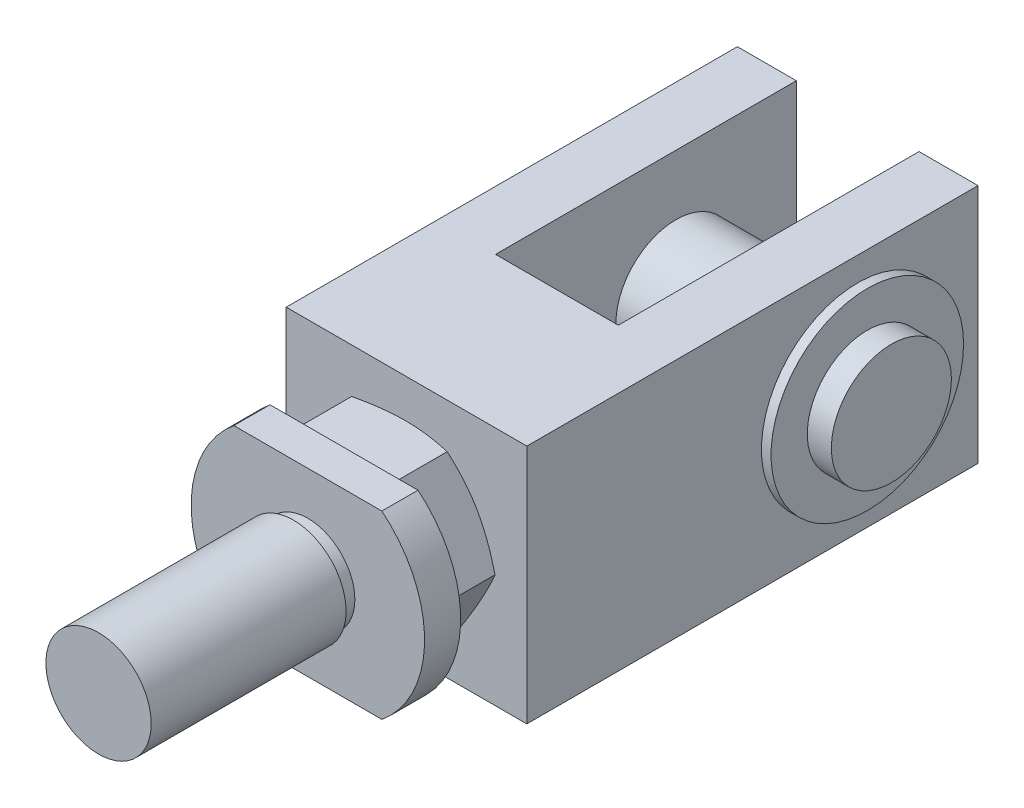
ISO-10303-21;
HEADER;
FILE_DESCRIPTION(('STEP AP214'),'2;1');
FILE_NAME('part.step','',(''),(''),'','','');
FILE_SCHEMA(('AUTOMOTIVE_DESIGN { 1 0 10303 214 1 1 1 1 }'));
ENDSEC;
DATA;
#1=APPLICATION_CONTEXT('core data for automotive mechanical design processes');
#2=APPLICATION_PROTOCOL_DEFINITION('international standard','automotive_design',2000,#1);
#3=PRODUCT_CONTEXT('',#1,'mechanical');
#4=PRODUCT('Part','Part','',(#3));
#5=PRODUCT_RELATED_PRODUCT_CATEGORY('part','',(#4));
#6=PRODUCT_DEFINITION_FORMATION('','',#4);
#7=PRODUCT_DEFINITION_CONTEXT('part definition',#1,'design');
#8=PRODUCT_DEFINITION('design','',#6,#7);
#9=PRODUCT_DEFINITION_SHAPE('','',#8);
#10=(LENGTH_UNIT() NAMED_UNIT(*) SI_UNIT(.MILLI.,.METRE.));
#11=(NAMED_UNIT(*) PLANE_ANGLE_UNIT() SI_UNIT($,.RADIAN.));
#12=(NAMED_UNIT(*) SI_UNIT($,.STERADIAN.) SOLID_ANGLE_UNIT());
#13=UNCERTAINTY_MEASURE_WITH_UNIT(LENGTH_MEASURE(1.E-05),#10,'distance_accuracy_value','');
#14=(GEOMETRIC_REPRESENTATION_CONTEXT(3) GLOBAL_UNCERTAINTY_ASSIGNED_CONTEXT((#13)) GLOBAL_UNIT_ASSIGNED_CONTEXT((#10,
#11,#12)) REPRESENTATION_CONTEXT('',''));
#15=CARTESIAN_POINT('',(0.,0.,0.));
#16=DIRECTION('',(0.,0.,1.));
#17=DIRECTION('',(1.,0.,0.));
#18=AXIS2_PLACEMENT_3D('',#15,#16,#17);
#19=CARTESIAN_POINT('',(6.477,-12.7,-26.2889942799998));
#20=DIRECTION('',(0.,0.,-1.));
#21=DIRECTION('',(-1.,0.,0.));
#22=AXIS2_PLACEMENT_3D('',#19,#20,#21);
#23=PLANE('',#22);
#24=CARTESIAN_POINT('',(0.,0.,-26.2889942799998));
#25=DIRECTION('',(0.,0.,-1.));
#26=DIRECTION('',(-1.,0.,0.));
#27=AXIS2_PLACEMENT_3D('',#24,#25,#26);
#28=CIRCLE('',#27,4.96062);
#29=CARTESIAN_POINT('',(-4.96062,0.,-26.2889942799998));
#30=VERTEX_POINT('',#29);
#31=EDGE_CURVE('E353',#30,#30,#28,.T.);
#32=ORIENTED_EDGE('',*,*,#31,.F.);
#33=EDGE_LOOP('',(#32));
#34=FACE_BOUND('',#33,.T.);
#35=DIRECTION('',(-1.,0.,0.));
#36=VECTOR('',#35,1.);
#37=CARTESIAN_POINT('',(6.477,12.7,-26.2889942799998));
#38=LINE('',#37,#36);
#39=CARTESIAN_POINT('',(6.477,12.7,-26.2889942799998));
#40=VERTEX_POINT('',#39);
#41=CARTESIAN_POINT('',(-6.477,12.7,-26.2889942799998));
#42=VERTEX_POINT('',#41);
#43=EDGE_CURVE('E363',#40,#42,#38,.T.);
#44=ORIENTED_EDGE('',*,*,#43,.F.);
#45=DIRECTION('',(0.,1.,0.));
#46=VECTOR('',#45,1.);
#47=CARTESIAN_POINT('',(6.477,-12.7,-26.2889942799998));
#48=LINE('',#47,#46);
#49=CARTESIAN_POINT('',(6.477,-12.7,-26.2889942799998));
#50=VERTEX_POINT('',#49);
#51=EDGE_CURVE('E409',#50,#40,#48,.T.);
#52=ORIENTED_EDGE('',*,*,#51,.F.);
#53=DIRECTION('',(-1.,0.,0.));
#54=VECTOR('',#53,1.);
#55=CARTESIAN_POINT('',(6.477,-12.7,-26.2889942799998));
#56=LINE('',#55,#54);
#57=CARTESIAN_POINT('',(-6.477,-12.7,-26.2889942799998));
#58=VERTEX_POINT('',#57);
#59=EDGE_CURVE('E386',#50,#58,#56,.T.);
#60=ORIENTED_EDGE('',*,*,#59,.T.);
#61=DIRECTION('',(0.,1.,0.));
#62=VECTOR('',#61,1.);
#63=CARTESIAN_POINT('',(-6.477,-12.7,-26.2889942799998));
#64=LINE('',#63,#62);
#65=EDGE_CURVE('E407',#58,#42,#64,.T.);
#66=ORIENTED_EDGE('',*,*,#65,.T.);
#67=EDGE_LOOP('',(#44,#52,#60,#66));
#68=FACE_BOUND('',#67,.T.);
#69=ADVANCED_FACE('F15',(#34,#68),#23,.T.);
#70=CARTESIAN_POINT('',(0.,0.,-58.0389942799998));
#71=DIRECTION('',(0.,0.,1.));
#72=DIRECTION('',(1.,0.,0.));
#73=AXIS2_PLACEMENT_3D('',#70,#71,#72);
#74=CYLINDRICAL_SURFACE('',#73,4.96062);
#75=CARTESIAN_POINT('',(0.,0.,-25.908));
#76=DIRECTION('',(0.,0.,-1.));
#77=DIRECTION('',(-1.,0.,0.));
#78=AXIS2_PLACEMENT_3D('',#75,#76,#77);
#79=CIRCLE('',#78,4.96062);
#80=CARTESIAN_POINT('',(-4.96062,0.,-25.908));
#81=VERTEX_POINT('',#80);
#82=EDGE_CURVE('E401',#81,#81,#79,.F.);
#83=ORIENTED_EDGE('',*,*,#82,.T.);
#84=EDGE_LOOP('',(#83));
#85=FACE_BOUND('',#84,.T.);
#86=ORIENTED_EDGE('',*,*,#31,.T.);
#87=EDGE_LOOP('',(#86));
#88=FACE_BOUND('',#87,.T.);
#89=ADVANCED_FACE('F469',(#85,#88),#74,.F.);
#90=CARTESIAN_POINT('',(12.7,-12.7,-58.0389942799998));
#91=DIRECTION('',(0.,0.,-1.));
#92=DIRECTION('',(-1.,0.,0.));
#93=AXIS2_PLACEMENT_3D('',#90,#91,#92);
#94=PLANE('',#93);
#95=DIRECTION('',(-1.,0.,0.));
#96=VECTOR('',#95,1.);
#97=CARTESIAN_POINT('',(12.7,12.7,-58.0389942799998));
#98=LINE('',#97,#96);
#99=CARTESIAN_POINT('',(12.7,12.7,-58.0389942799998));
#100=VERTEX_POINT('',#99);
#101=CARTESIAN_POINT('',(6.477,12.7,-58.0389942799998));
#102=VERTEX_POINT('',#101);
#103=EDGE_CURVE('E357',#100,#102,#98,.T.);
#104=ORIENTED_EDGE('',*,*,#103,.F.);
#105=DIRECTION('',(0.,1.,0.));
#106=VECTOR('',#105,1.);
#107=CARTESIAN_POINT('',(12.7,-12.7,-58.0389942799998));
#108=LINE('',#107,#106);
#109=CARTESIAN_POINT('',(12.7,-12.7,-58.0389942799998));
#110=VERTEX_POINT('',#109);
#111=EDGE_CURVE('E399',#110,#100,#108,.T.);
#112=ORIENTED_EDGE('',*,*,#111,.F.);
#113=DIRECTION('',(-1.,0.,0.));
#114=VECTOR('',#113,1.);
#115=CARTESIAN_POINT('',(12.7,-12.7,-58.0389942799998));
#116=LINE('',#115,#114);
#117=CARTESIAN_POINT('',(6.477,-12.7,-58.0389942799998));
#118=VERTEX_POINT('',#117);
#119=EDGE_CURVE('E380',#110,#118,#116,.T.);
#120=ORIENTED_EDGE('',*,*,#119,.T.);
#121=DIRECTION('',(0.,1.,0.));
#122=VECTOR('',#121,1.);
#123=CARTESIAN_POINT('',(6.477,-12.7,-58.0389942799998));
#124=LINE('',#123,#122);
#125=EDGE_CURVE('E411',#118,#102,#124,.T.);
#126=ORIENTED_EDGE('',*,*,#125,.T.);
#127=EDGE_LOOP('',(#104,#112,#120,#126));
#128=FACE_BOUND('',#127,.T.);
#129=ADVANCED_FACE('F444',(#128),#94,.T.);
#130=CARTESIAN_POINT('',(12.7,-12.7,-10.4139942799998));
#131=DIRECTION('',(1.,0.,0.));
#132=DIRECTION('',(0.,0.,-1.));
#133=AXIS2_PLACEMENT_3D('',#130,#131,#132);
#134=PLANE('',#133);
#135=DIRECTION('',(0.,0.,-1.));
#136=VECTOR('',#135,1.);
#137=CARTESIAN_POINT('',(12.7,12.7,-10.4139942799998));
#138=LINE('',#137,#136);
#139=CARTESIAN_POINT('',(12.7,12.7,-10.4139942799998));
#140=VERTEX_POINT('',#139);
#141=EDGE_CURVE('E354',#140,#100,#138,.T.);
#142=ORIENTED_EDGE('',*,*,#141,.F.);
#143=DIRECTION('',(0.,1.,0.));
#144=VECTOR('',#143,1.);
#145=CARTESIAN_POINT('',(12.7,-12.7,-10.4139942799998));
#146=LINE('',#145,#144);
#147=CARTESIAN_POINT('',(12.7,-12.7,-10.4139942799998));
#148=VERTEX_POINT('',#147);
#149=EDGE_CURVE('E30',#148,#140,#146,.T.);
#150=ORIENTED_EDGE('',*,*,#149,.F.);
#151=DIRECTION('',(0.,0.,-1.));
#152=VECTOR('',#151,1.);
#153=CARTESIAN_POINT('',(12.7,-12.7,-10.4139942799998));
#154=LINE('',#153,#152);
#155=EDGE_CURVE('E378',#148,#110,#154,.T.);
#156=ORIENTED_EDGE('',*,*,#155,.T.);
#157=ORIENTED_EDGE('',*,*,#111,.T.);
#158=EDGE_LOOP('',(#142,#150,#156,#157));
#159=FACE_BOUND('',#158,.T.);
#160=CARTESIAN_POINT('',(12.7,0.,-45.3389942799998));
#161=DIRECTION('',(1.,0.,0.));
#162=DIRECTION('',(0.,0.,-1.));
#163=AXIS2_PLACEMENT_3D('',#160,#161,#162);
#164=CIRCLE('',#163,10.16);
#165=CARTESIAN_POINT('',(12.7,0.,-55.4989942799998));
#166=VERTEX_POINT('',#165);
#167=EDGE_CURVE('E9',#166,#166,#164,.F.);
#168=ORIENTED_EDGE('',*,*,#167,.T.);
#169=EDGE_LOOP('',(#168));
#170=FACE_BOUND('',#169,.T.);
#171=ADVANCED_FACE('F17',(#159,#170),#134,.T.);
#172=CARTESIAN_POINT('',(12.7,-12.7,-10.4139942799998));
#173=DIRECTION('',(0.,0.,1.));
#174=DIRECTION('',(1.,0.,0.));
#175=AXIS2_PLACEMENT_3D('',#172,#173,#174);
#176=PLANE('',#175);
#177=CARTESIAN_POINT('',(0.,0.,-10.4139942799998));
#178=DIRECTION('',(0.,0.,1.));
#179=DIRECTION('',(0.,-1.,0.));
#180=AXIS2_PLACEMENT_3D('',#177,#178,#179);
#181=CIRCLE('',#180,8.47501425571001);
#182=CARTESIAN_POINT('',(0.,-8.47501425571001,-10.4139942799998));
#183=VERTEX_POINT('',#182);
#184=EDGE_CURVE('E23',#183,#183,#181,.T.);
#185=ORIENTED_EDGE('',*,*,#184,.F.);
#186=EDGE_LOOP('',(#185));
#187=FACE_BOUND('',#186,.T.);
#188=DIRECTION('',(1.,0.,0.));
#189=VECTOR('',#188,1.);
#190=CARTESIAN_POINT('',(12.7,12.7,-10.4139942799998));
#191=LINE('',#190,#189);
#192=CARTESIAN_POINT('',(-12.7,12.7,-10.4139942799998));
#193=VERTEX_POINT('',#192);
#194=EDGE_CURVE('E375',#193,#140,#191,.T.);
#195=ORIENTED_EDGE('',*,*,#194,.F.);
#196=DIRECTION('',(0.,1.,0.));
#197=VECTOR('',#196,1.);
#198=CARTESIAN_POINT('',(-12.7,-12.7,-10.4139942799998));
#199=LINE('',#198,#197);
#200=CARTESIAN_POINT('',(-12.7,-12.7,-10.4139942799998));
#201=VERTEX_POINT('',#200);
#202=EDGE_CURVE('E38',#201,#193,#199,.T.);
#203=ORIENTED_EDGE('',*,*,#202,.F.);
#204=DIRECTION('',(1.,0.,0.));
#205=VECTOR('',#204,1.);
#206=CARTESIAN_POINT('',(12.7,-12.7,-10.4139942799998));
#207=LINE('',#206,#205);
#208=EDGE_CURVE('E397',#201,#148,#207,.T.);
#209=ORIENTED_EDGE('',*,*,#208,.T.);
#210=ORIENTED_EDGE('',*,*,#149,.T.);
#211=EDGE_LOOP('',(#195,#203,#209,#210));
#212=FACE_BOUND('',#211,.T.);
#213=ADVANCED_FACE('F425',(#187,#212),#176,.T.);
#214=CARTESIAN_POINT('',(12.7,-12.7,-58.0389942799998));
#215=DIRECTION('',(0.,1.,0.));
#216=DIRECTION('',(0.,0.,-1.));
#217=AXIS2_PLACEMENT_3D('',#214,#215,#216);
#218=PLANE('',#217);
#219=ORIENTED_EDGE('',*,*,#155,.F.);
#220=ORIENTED_EDGE('',*,*,#208,.F.);
#221=DIRECTION('',(0.,0.,1.));
#222=VECTOR('',#221,1.);
#223=CARTESIAN_POINT('',(-12.7,-12.7,-10.4139942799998));
#224=LINE('',#223,#222);
#225=CARTESIAN_POINT('',(-12.7,-12.7,-58.0389942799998));
#226=VERTEX_POINT('',#225);
#227=EDGE_CURVE('E395',#226,#201,#224,.T.);
#228=ORIENTED_EDGE('',*,*,#227,.F.);
#229=DIRECTION('',(-1.,0.,0.));
#230=VECTOR('',#229,1.);
#231=CARTESIAN_POINT('',(-6.477,-12.7,-58.0389942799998));
#232=LINE('',#231,#230);
#233=CARTESIAN_POINT('',(-6.477,-12.7,-58.0389942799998));
#234=VERTEX_POINT('',#233);
#235=EDGE_CURVE('E392',#234,#226,#232,.T.);
#236=ORIENTED_EDGE('',*,*,#235,.F.);
#237=DIRECTION('',(0.,0.,-1.));
#238=VECTOR('',#237,1.);
#239=CARTESIAN_POINT('',(-6.477,-12.7,-26.2889942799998));
#240=LINE('',#239,#238);
#241=EDGE_CURVE('E389',#58,#234,#240,.T.);
#242=ORIENTED_EDGE('',*,*,#241,.F.);
#243=ORIENTED_EDGE('',*,*,#59,.F.);
#244=DIRECTION('',(0.,0.,1.));
#245=VECTOR('',#244,1.);
#246=CARTESIAN_POINT('',(6.477,-12.7,-58.0389942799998));
#247=LINE('',#246,#245);
#248=EDGE_CURVE('E383',#118,#50,#247,.T.);
#249=ORIENTED_EDGE('',*,*,#248,.F.);
#250=ORIENTED_EDGE('',*,*,#119,.F.);
#251=EDGE_LOOP('',(#219,#220,#228,#236,#242,#243,#249,#250));
#252=FACE_BOUND('',#251,.T.);
#253=ADVANCED_FACE('F427',(#252),#218,.F.);
#254=CARTESIAN_POINT('',(-6.477,-12.7,-58.0389942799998));
#255=DIRECTION('',(0.,0.,-1.));
#256=DIRECTION('',(-1.,0.,0.));
#257=AXIS2_PLACEMENT_3D('',#254,#255,#256);
#258=PLANE('',#257);
#259=DIRECTION('',(-1.,0.,0.));
#260=VECTOR('',#259,1.);
#261=CARTESIAN_POINT('',(-6.477,12.7,-58.0389942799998));
#262=LINE('',#261,#260);
#263=CARTESIAN_POINT('',(-6.477,12.7,-58.0389942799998));
#264=VERTEX_POINT('',#263);
#265=CARTESIAN_POINT('',(-12.7,12.7,-58.0389942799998));
#266=VERTEX_POINT('',#265);
#267=EDGE_CURVE('E369',#264,#266,#262,.T.);
#268=ORIENTED_EDGE('',*,*,#267,.F.);
#269=DIRECTION('',(0.,1.,0.));
#270=VECTOR('',#269,1.);
#271=CARTESIAN_POINT('',(-6.477,-12.7,-58.0389942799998));
#272=LINE('',#271,#270);
#273=EDGE_CURVE('E405',#234,#264,#272,.T.);
#274=ORIENTED_EDGE('',*,*,#273,.F.);
#275=ORIENTED_EDGE('',*,*,#235,.T.);
#276=DIRECTION('',(0.,1.,0.));
#277=VECTOR('',#276,1.);
#278=CARTESIAN_POINT('',(-12.7,-12.7,-58.0389942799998));
#279=LINE('',#278,#277);
#280=EDGE_CURVE('E403',#226,#266,#279,.T.);
#281=ORIENTED_EDGE('',*,*,#280,.T.);
#282=EDGE_LOOP('',(#268,#274,#275,#281));
#283=FACE_BOUND('',#282,.T.);
#284=ADVANCED_FACE('F456',(#283),#258,.T.);
#285=CARTESIAN_POINT('',(12.7,12.7,-58.0389942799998));
#286=DIRECTION('',(0.,1.,0.));
#287=DIRECTION('',(0.,0.,-1.));
#288=AXIS2_PLACEMENT_3D('',#285,#286,#287);
#289=PLANE('',#288);
#290=ORIENTED_EDGE('',*,*,#141,.T.);
#291=ORIENTED_EDGE('',*,*,#103,.T.);
#292=DIRECTION('',(0.,0.,1.));
#293=VECTOR('',#292,1.);
#294=CARTESIAN_POINT('',(6.477,12.7,-58.0389942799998));
#295=LINE('',#294,#293);
#296=EDGE_CURVE('E360',#102,#40,#295,.T.);
#297=ORIENTED_EDGE('',*,*,#296,.T.);
#298=ORIENTED_EDGE('',*,*,#43,.T.);
#299=DIRECTION('',(0.,0.,-1.));
#300=VECTOR('',#299,1.);
#301=CARTESIAN_POINT('',(-6.477,12.7,-26.2889942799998));
#302=LINE('',#301,#300);
#303=EDGE_CURVE('E366',#42,#264,#302,.T.);
#304=ORIENTED_EDGE('',*,*,#303,.T.);
#305=ORIENTED_EDGE('',*,*,#267,.T.);
#306=DIRECTION('',(0.,0.,1.));
#307=VECTOR('',#306,1.);
#308=CARTESIAN_POINT('',(-12.7,12.7,-10.4139942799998));
#309=LINE('',#308,#307);
#310=EDGE_CURVE('E372',#266,#193,#309,.T.);
#311=ORIENTED_EDGE('',*,*,#310,.T.);
#312=ORIENTED_EDGE('',*,*,#194,.T.);
#313=EDGE_LOOP('',(#290,#291,#297,#298,#304,#305,#311,#312));
#314=FACE_BOUND('',#313,.T.);
#315=ADVANCED_FACE('F430',(#314),#289,.T.);
#316=CARTESIAN_POINT('',(-12.7,-12.7,-10.4139942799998));
#317=DIRECTION('',(-1.,0.,0.));
#318=DIRECTION('',(0.,0.,1.));
#319=AXIS2_PLACEMENT_3D('',#316,#317,#318);
#320=PLANE('',#319);
#321=CARTESIAN_POINT('',(-12.7,0.,-45.3389942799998));
#322=DIRECTION('',(-1.,0.,0.));
#323=DIRECTION('',(0.,-1.,0.));
#324=AXIS2_PLACEMENT_3D('',#321,#322,#323);
#325=CIRCLE('',#324,8.001);
#326=CARTESIAN_POINT('',(-12.7,-8.001,-45.3389942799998));
#327=VERTEX_POINT('',#326);
#328=EDGE_CURVE('E420',#327,#327,#325,.T.);
#329=ORIENTED_EDGE('',*,*,#328,.F.);
#330=EDGE_LOOP('',(#329));
#331=FACE_BOUND('',#330,.T.);
#332=ORIENTED_EDGE('',*,*,#310,.F.);
#333=ORIENTED_EDGE('',*,*,#280,.F.);
#334=ORIENTED_EDGE('',*,*,#227,.T.);
#335=ORIENTED_EDGE('',*,*,#202,.T.);
#336=EDGE_LOOP('',(#332,#333,#334,#335));
#337=FACE_BOUND('',#336,.T.);
#338=ADVANCED_FACE('F434',(#331,#337),#320,.T.);
#339=CARTESIAN_POINT('',(-6.477,-12.7,-26.2889942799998));
#340=DIRECTION('',(1.,0.,0.));
#341=DIRECTION('',(0.,0.,-1.));
#342=AXIS2_PLACEMENT_3D('',#339,#340,#341);
#343=PLANE('',#342);
#344=CARTESIAN_POINT('',(-6.477,0.,-45.3389942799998));
#345=DIRECTION('',(1.,0.,0.));
#346=DIRECTION('',(0.,0.,-1.));
#347=AXIS2_PLACEMENT_3D('',#344,#345,#346);
#348=CIRCLE('',#347,6.35);
#349=CARTESIAN_POINT('',(-6.477,0.,-51.6889942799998));
#350=VERTEX_POINT('',#349);
#351=EDGE_CURVE('E350',#350,#350,#348,.T.);
#352=ORIENTED_EDGE('',*,*,#351,.F.);
#353=EDGE_LOOP('',(#352));
#354=FACE_BOUND('',#353,.T.);
#355=ORIENTED_EDGE('',*,*,#303,.F.);
#356=ORIENTED_EDGE('',*,*,#65,.F.);
#357=ORIENTED_EDGE('',*,*,#241,.T.);
#358=ORIENTED_EDGE('',*,*,#273,.T.);
#359=EDGE_LOOP('',(#355,#356,#357,#358));
#360=FACE_BOUND('',#359,.T.);
#361=ADVANCED_FACE('F454',(#354,#360),#343,.T.);
#362=CARTESIAN_POINT('',(12.7,0.,-45.3389942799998));
#363=DIRECTION('',(-1.,0.,0.));
#364=DIRECTION('',(0.,0.,1.));
#365=AXIS2_PLACEMENT_3D('',#362,#363,#364);
#366=CYLINDRICAL_SURFACE('',#365,6.35);
#367=ORIENTED_EDGE('',*,*,#351,.T.);
#368=EDGE_LOOP('',(#367));
#369=FACE_BOUND('',#368,.T.);
#370=CARTESIAN_POINT('',(-12.7,0.,-45.3389942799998));
#371=DIRECTION('',(-1.,0.,0.));
#372=DIRECTION('',(0.,0.,1.));
#373=AXIS2_PLACEMENT_3D('',#370,#371,#372);
#374=CIRCLE('',#373,6.35);
#375=CARTESIAN_POINT('',(-12.7,0.,-38.9889942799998));
#376=VERTEX_POINT('',#375);
#377=EDGE_CURVE('E343',#376,#376,#374,.T.);
#378=ORIENTED_EDGE('',*,*,#377,.T.);
#379=EDGE_LOOP('',(#378));
#380=FACE_BOUND('',#379,.T.);
#381=ADVANCED_FACE('F481',(#369,#380),#366,.F.);
#382=CARTESIAN_POINT('',(6.477,-12.7,-58.0389942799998));
#383=DIRECTION('',(-1.,0.,0.));
#384=DIRECTION('',(0.,0.,1.));
#385=AXIS2_PLACEMENT_3D('',#382,#383,#384);
#386=PLANE('',#385);
#387=CARTESIAN_POINT('',(6.477,0.,-45.3389942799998));
#388=DIRECTION('',(-1.,0.,0.));
#389=DIRECTION('',(0.,0.,1.));
#390=AXIS2_PLACEMENT_3D('',#387,#388,#389);
#391=CIRCLE('',#390,6.35);
#392=CARTESIAN_POINT('',(6.477,0.,-38.9889942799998));
#393=VERTEX_POINT('',#392);
#394=EDGE_CURVE('E349',#393,#393,#391,.T.);
#395=ORIENTED_EDGE('',*,*,#394,.F.);
#396=EDGE_LOOP('',(#395));
#397=FACE_BOUND('',#396,.T.);
#398=ORIENTED_EDGE('',*,*,#296,.F.);
#399=ORIENTED_EDGE('',*,*,#125,.F.);
#400=ORIENTED_EDGE('',*,*,#248,.T.);
#401=ORIENTED_EDGE('',*,*,#51,.T.);
#402=EDGE_LOOP('',(#398,#399,#400,#401));
#403=FACE_BOUND('',#402,.T.);
#404=ADVANCED_FACE('F448',(#397,#403),#386,.T.);
#405=ORIENTED_EDGE('',*,*,#394,.T.);
#406=EDGE_LOOP('',(#405));
#407=FACE_BOUND('',#406,.T.);
#408=CARTESIAN_POINT('',(12.7,0.,-45.3389942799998));
#409=DIRECTION('',(-1.,0.,0.));
#410=DIRECTION('',(0.,0.,1.));
#411=AXIS2_PLACEMENT_3D('',#408,#409,#410);
#412=CIRCLE('',#411,6.35);
#413=CARTESIAN_POINT('',(12.7,0.,-38.9889942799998));
#414=VERTEX_POINT('',#413);
#415=EDGE_CURVE('E346',#414,#414,#412,.T.);
#416=ORIENTED_EDGE('',*,*,#415,.F.);
#417=EDGE_LOOP('',(#416));
#418=FACE_BOUND('',#417,.T.);
#419=ADVANCED_FACE('F480',(#407,#418),#366,.F.);
#420=CARTESIAN_POINT('',(16.256,0.,-45.3389942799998));
#421=DIRECTION('',(-1.,0.,0.));
#422=DIRECTION('',(0.,0.,1.));
#423=AXIS2_PLACEMENT_3D('',#420,#421,#422);
#424=CYLINDRICAL_SURFACE('',#423,6.3373);
#425=CARTESIAN_POINT('',(-12.7,0.,-45.3389942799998));
#426=DIRECTION('',(-1.,0.,0.));
#427=DIRECTION('',(0.,0.,1.));
#428=AXIS2_PLACEMENT_3D('',#425,#426,#427);
#429=CIRCLE('',#428,6.3373);
#430=CARTESIAN_POINT('',(-12.7,0.,-39.0016942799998));
#431=VERTEX_POINT('',#430);
#432=EDGE_CURVE('E983',#431,#431,#429,.F.);
#433=ORIENTED_EDGE('',*,*,#432,.T.);
#434=EDGE_LOOP('',(#433));
#435=FACE_BOUND('',#434,.T.);
#436=CARTESIAN_POINT('',(12.7,0.,-45.3389942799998));
#437=DIRECTION('',(1.,0.,0.));
#438=DIRECTION('',(0.,0.,-1.));
#439=AXIS2_PLACEMENT_3D('',#436,#437,#438);
#440=CIRCLE('',#439,6.3373);
#441=CARTESIAN_POINT('',(12.7,0.,-51.6762942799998));
#442=VERTEX_POINT('',#441);
#443=EDGE_CURVE('E278',#442,#442,#440,.T.);
#444=ORIENTED_EDGE('',*,*,#443,.F.);
#445=EDGE_LOOP('',(#444));
#446=FACE_BOUND('',#445,.T.);
#447=ADVANCED_FACE('F559',(#435,#446),#424,.T.);
#448=CARTESIAN_POINT('',(-12.7,0.,-45.3389942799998));
#449=DIRECTION('',(-1.,0.,0.));
#450=DIRECTION('',(0.,0.,1.));
#451=AXIS2_PLACEMENT_3D('',#448,#449,#450);
#452=PLANE('',#451);
#453=ORIENTED_EDGE('',*,*,#432,.F.);
#454=EDGE_LOOP('',(#453));
#455=FACE_BOUND('',#454,.T.);
#456=ORIENTED_EDGE('',*,*,#377,.F.);
#457=EDGE_LOOP('',(#456));
#458=FACE_BOUND('',#457,.T.);
#459=ADVANCED_FACE('F569',(#455,#458),#452,.F.);
#460=CARTESIAN_POINT('',(12.7,0.,-45.3389942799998));
#461=DIRECTION('',(1.,0.,0.));
#462=DIRECTION('',(0.,0.,-1.));
#463=AXIS2_PLACEMENT_3D('',#460,#461,#462);
#464=PLANE('',#463);
#465=ORIENTED_EDGE('',*,*,#443,.T.);
#466=EDGE_LOOP('',(#465));
#467=FACE_BOUND('',#466,.T.);
#468=ORIENTED_EDGE('',*,*,#415,.T.);
#469=EDGE_LOOP('',(#468));
#470=FACE_BOUND('',#469,.T.);
#471=ADVANCED_FACE('F581',(#467,#470),#464,.F.);
#472=CARTESIAN_POINT('',(-16.002,0.,-45.3389942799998));
#473=DIRECTION('',(-1.,0.,0.));
#474=DIRECTION('',(0.,0.,1.));
#475=AXIS2_PLACEMENT_3D('',#472,#473,#474);
#476=PLANE('',#475);
#477=CARTESIAN_POINT('',(-16.002,0.,-45.3389942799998));
#478=DIRECTION('',(-1.,0.,0.));
#479=DIRECTION('',(0.,0.,1.));
#480=AXIS2_PLACEMENT_3D('',#477,#478,#479);
#481=CIRCLE('',#480,8.001);
#482=CARTESIAN_POINT('',(-16.002,0.,-37.3379942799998));
#483=VERTEX_POINT('',#482);
#484=EDGE_CURVE('E986',#483,#483,#481,.T.);
#485=ORIENTED_EDGE('',*,*,#484,.T.);
#486=EDGE_LOOP('',(#485));
#487=FACE_BOUND('',#486,.T.);
#488=ADVANCED_FACE('F592',(#487),#476,.T.);
#489=CARTESIAN_POINT('',(-12.7,0.,-45.3389942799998));
#490=DIRECTION('',(-1.,0.,0.));
#491=DIRECTION('',(0.,0.,1.));
#492=AXIS2_PLACEMENT_3D('',#489,#490,#491);
#493=CYLINDRICAL_SURFACE('',#492,8.001);
#494=ORIENTED_EDGE('',*,*,#328,.T.);
#495=EDGE_LOOP('',(#494));
#496=FACE_BOUND('',#495,.T.);
#497=ORIENTED_EDGE('',*,*,#484,.F.);
#498=EDGE_LOOP('',(#497));
#499=FACE_BOUND('',#498,.T.);
#500=ADVANCED_FACE('F604',(#496,#499),#493,.T.);
#501=CARTESIAN_POINT('',(16.256,0.,-45.3389942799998));
#502=DIRECTION('',(1.,0.,0.));
#503=DIRECTION('',(0.,0.,-1.));
#504=AXIS2_PLACEMENT_3D('',#501,#502,#503);
#505=PLANE('',#504);
#506=CARTESIAN_POINT('',(16.256,0.,-45.3389942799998));
#507=DIRECTION('',(1.,0.,0.));
#508=DIRECTION('',(0.,0.,-1.));
#509=AXIS2_PLACEMENT_3D('',#506,#507,#508);
#510=CIRCLE('',#509,6.3373);
#511=CARTESIAN_POINT('',(16.256,0.,-51.6762942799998));
#512=VERTEX_POINT('',#511);
#513=EDGE_CURVE('E979',#512,#512,#510,.T.);
#514=ORIENTED_EDGE('',*,*,#513,.T.);
#515=EDGE_LOOP('',(#514));
#516=FACE_BOUND('',#515,.T.);
#517=ADVANCED_FACE('F615',(#516),#505,.T.);
#518=CARTESIAN_POINT('',(13.716,0.,-45.3389942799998));
#519=DIRECTION('',(1.,0.,0.));
#520=DIRECTION('',(0.,0.,-1.));
#521=AXIS2_PLACEMENT_3D('',#518,#519,#520);
#522=CIRCLE('',#521,6.3373);
#523=CARTESIAN_POINT('',(13.716,0.,-51.6762942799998));
#524=VERTEX_POINT('',#523);
#525=EDGE_CURVE('E976',#524,#524,#522,.T.);
#526=ORIENTED_EDGE('',*,*,#525,.T.);
#527=EDGE_LOOP('',(#526));
#528=FACE_BOUND('',#527,.T.);
#529=ORIENTED_EDGE('',*,*,#513,.F.);
#530=EDGE_LOOP('',(#529));
#531=FACE_BOUND('',#530,.T.);
#532=ADVANCED_FACE('F572',(#528,#531),#424,.T.);
#533=CARTESIAN_POINT('',(13.716,0.,-45.3389942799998));
#534=DIRECTION('',(1.,0.,0.));
#535=DIRECTION('',(0.,0.,-1.));
#536=AXIS2_PLACEMENT_3D('',#533,#534,#535);
#537=PLANE('',#536);
#538=CARTESIAN_POINT('',(13.716,0.,-45.3389942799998));
#539=DIRECTION('',(1.,0.,0.));
#540=DIRECTION('',(0.,0.,-1.));
#541=AXIS2_PLACEMENT_3D('',#538,#539,#540);
#542=CIRCLE('',#541,10.16);
#543=CARTESIAN_POINT('',(13.716,0.,-55.4989942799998));
#544=VERTEX_POINT('',#543);
#545=EDGE_CURVE('E980',#544,#544,#542,.T.);
#546=ORIENTED_EDGE('',*,*,#545,.T.);
#547=EDGE_LOOP('',(#546));
#548=FACE_BOUND('',#547,.T.);
#549=ORIENTED_EDGE('',*,*,#525,.F.);
#550=EDGE_LOOP('',(#549));
#551=FACE_BOUND('',#550,.T.);
#552=ADVANCED_FACE('F636',(#548,#551),#537,.T.);
#553=CARTESIAN_POINT('',(13.716,0.,-45.3389942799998));
#554=DIRECTION('',(-1.,0.,0.));
#555=DIRECTION('',(0.,0.,1.));
#556=AXIS2_PLACEMENT_3D('',#553,#554,#555);
#557=CYLINDRICAL_SURFACE('',#556,10.16);
#558=ORIENTED_EDGE('',*,*,#545,.F.);
#559=EDGE_LOOP('',(#558));
#560=FACE_BOUND('',#559,.T.);
#561=ORIENTED_EDGE('',*,*,#167,.F.);
#562=EDGE_LOOP('',(#561));
#563=FACE_BOUND('',#562,.T.);
#564=ADVANCED_FACE('F627',(#560,#563),#557,.T.);
#565=CARTESIAN_POINT('',(0.,0.,-25.908));
#566=DIRECTION('',(0.,0.,-1.));
#567=DIRECTION('',(-1.,0.,0.));
#568=AXIS2_PLACEMENT_3D('',#565,#566,#567);
#569=PLANE('',#568);
#570=ORIENTED_EDGE('',*,*,#82,.F.);
#571=EDGE_LOOP('',(#570));
#572=FACE_BOUND('',#571,.T.);
#573=ADVANCED_FACE('F595',(#572),#569,.T.);
#574=CARTESIAN_POINT('',(0.,0.,22.098));
#575=DIRECTION('',(0.,0.,1.));
#576=DIRECTION('',(1.,0.,0.));
#577=AXIS2_PLACEMENT_3D('',#574,#575,#576);
#578=PLANE('',#577);
#579=CARTESIAN_POINT('',(0.,0.,22.098));
#580=DIRECTION('',(0.,0.,1.));
#581=DIRECTION('',(1.,0.,0.));
#582=AXIS2_PLACEMENT_3D('',#579,#580,#581);
#583=CIRCLE('',#582,5.55625);
#584=CARTESIAN_POINT('',(5.55625,0.,22.098));
#585=VERTEX_POINT('',#584);
#586=EDGE_CURVE('E315',#585,#585,#583,.T.);
#587=ORIENTED_EDGE('',*,*,#586,.T.);
#588=EDGE_LOOP('',(#587));
#589=FACE_BOUND('',#588,.T.);
#590=ADVANCED_FACE('F666',(#589),#578,.T.);
#591=CARTESIAN_POINT('',(0.,0.,22.098));
#592=DIRECTION('',(0.,0.,-1.));
#593=DIRECTION('',(-1.,0.,0.));
#594=AXIS2_PLACEMENT_3D('',#591,#592,#593);
#595=CYLINDRICAL_SURFACE('',#594,5.55625);
#596=ORIENTED_EDGE('',*,*,#586,.F.);
#597=EDGE_LOOP('',(#596));
#598=FACE_BOUND('',#597,.T.);
#599=CARTESIAN_POINT('',(0.,0.,1.524));
#600=DIRECTION('',(0.,0.,1.));
#601=DIRECTION('',(1.,0.,0.));
#602=AXIS2_PLACEMENT_3D('',#599,#600,#601);
#603=CIRCLE('',#602,5.55625);
#604=CARTESIAN_POINT('',(5.55625,0.,1.524));
#605=VERTEX_POINT('',#604);
#606=EDGE_CURVE('E312',#605,#605,#603,.T.);
#607=ORIENTED_EDGE('',*,*,#606,.T.);
#608=EDGE_LOOP('',(#607));
#609=FACE_BOUND('',#608,.T.);
#610=ADVANCED_FACE('F677',(#598,#609),#595,.T.);
#611=CARTESIAN_POINT('',(0.,0.,1.524));
#612=DIRECTION('',(0.,0.,1.));
#613=DIRECTION('',(1.,0.,0.));
#614=AXIS2_PLACEMENT_3D('',#611,#612,#613);
#615=PLANE('',#614);
#616=ORIENTED_EDGE('',*,*,#606,.F.);
#617=EDGE_LOOP('',(#616));
#618=FACE_BOUND('',#617,.T.);
#619=CARTESIAN_POINT('',(0.,0.,1.524));
#620=DIRECTION('',(0.,0.,1.));
#621=DIRECTION('',(1.,0.,0.));
#622=AXIS2_PLACEMENT_3D('',#619,#620,#621);
#623=CIRCLE('',#622,4.96062);
#624=CARTESIAN_POINT('',(4.96062,0.,1.524));
#625=VERTEX_POINT('',#624);
#626=EDGE_CURVE('E318',#625,#625,#623,.T.);
#627=ORIENTED_EDGE('',*,*,#626,.T.);
#628=EDGE_LOOP('',(#627));
#629=FACE_BOUND('',#628,.T.);
#630=ADVANCED_FACE('F688',(#618,#629),#615,.F.);
#631=CARTESIAN_POINT('',(0.,0.,1.524));
#632=DIRECTION('',(0.,0.,-1.));
#633=DIRECTION('',(-1.,0.,0.));
#634=AXIS2_PLACEMENT_3D('',#631,#632,#633);
#635=CYLINDRICAL_SURFACE('',#634,4.96062);
#636=CARTESIAN_POINT('',(0.,0.,0.));
#637=DIRECTION('',(0.,0.,1.));
#638=DIRECTION('',(1.,0.,0.));
#639=AXIS2_PLACEMENT_3D('',#636,#637,#638);
#640=CIRCLE('',#639,4.96062);
#641=CARTESIAN_POINT('',(4.96062,0.,0.));
#642=VERTEX_POINT('',#641);
#643=EDGE_CURVE('E305',#642,#642,#640,.T.);
#644=ORIENTED_EDGE('',*,*,#643,.T.);
#645=EDGE_LOOP('',(#644));
#646=FACE_BOUND('',#645,.T.);
#647=ORIENTED_EDGE('',*,*,#626,.F.);
#648=EDGE_LOOP('',(#647));
#649=FACE_BOUND('',#648,.T.);
#650=ADVANCED_FACE('F699',(#646,#649),#635,.T.);
#651=CARTESIAN_POINT('',(0.,0.,0.));
#652=DIRECTION('',(0.,0.,1.));
#653=DIRECTION('',(1.,0.,0.));
#654=AXIS2_PLACEMENT_3D('',#651,#652,#653);
#655=PLANE('',#654);
#656=DIRECTION('',(1.,0.,0.));
#657=VECTOR('',#656,1.);
#658=CARTESIAN_POINT('',(-7.81230670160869,9.525,0.));
#659=LINE('',#658,#657);
#660=CARTESIAN_POINT('',(-7.81230670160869,9.525,0.));
#661=VERTEX_POINT('',#660);
#662=CARTESIAN_POINT('',(7.81230670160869,9.525,0.));
#663=VERTEX_POINT('',#662);
#664=EDGE_CURVE('E283',#661,#663,#659,.T.);
#665=ORIENTED_EDGE('',*,*,#664,.F.);
#666=CARTESIAN_POINT('',(0.,0.,0.));
#667=DIRECTION('',(0.,0.,1.));
#668=DIRECTION('',(1.,0.,0.));
#669=AXIS2_PLACEMENT_3D('',#666,#667,#668);
#670=CIRCLE('',#669,12.319);
#671=CARTESIAN_POINT('',(-7.81230670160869,-9.525,0.));
#672=VERTEX_POINT('',#671);
#673=EDGE_CURVE('E301',#661,#672,#670,.T.);
#674=ORIENTED_EDGE('',*,*,#673,.T.);
#675=DIRECTION('',(-1.,0.,0.));
#676=VECTOR('',#675,1.);
#677=CARTESIAN_POINT('',(-7.81230670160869,-9.525,0.));
#678=LINE('',#677,#676);
#679=CARTESIAN_POINT('',(7.81230670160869,-9.525,0.));
#680=VERTEX_POINT('',#679);
#681=EDGE_CURVE('E289',#680,#672,#678,.T.);
#682=ORIENTED_EDGE('',*,*,#681,.F.);
#683=EDGE_CURVE('E302',#680,#663,#670,.T.);
#684=ORIENTED_EDGE('',*,*,#683,.T.);
#685=EDGE_LOOP('',(#665,#674,#682,#684));
#686=FACE_BOUND('',#685,.T.);
#687=ORIENTED_EDGE('',*,*,#643,.F.);
#688=EDGE_LOOP('',(#687));
#689=FACE_BOUND('',#688,.T.);
#690=ADVANCED_FACE('F710',(#686,#689),#655,.T.);
#691=CARTESIAN_POINT('',(-7.81230670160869,-9.525,-25.908));
#692=DIRECTION('',(0.,1.,0.));
#693=DIRECTION('',(0.,0.,1.));
#694=AXIS2_PLACEMENT_3D('',#691,#692,#693);
#695=PLANE('',#694);
#696=DIRECTION('',(0.,0.,-1.));
#697=VECTOR('',#696,1.);
#698=CARTESIAN_POINT('',(7.81230670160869,-9.525,0.));
#699=LINE('',#698,#697);
#700=CARTESIAN_POINT('',(7.81230670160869,-9.525,-3.81));
#701=VERTEX_POINT('',#700);
#702=EDGE_CURVE('E329',#680,#701,#699,.T.);
#703=ORIENTED_EDGE('',*,*,#702,.F.);
#704=ORIENTED_EDGE('',*,*,#681,.T.);
#705=DIRECTION('',(0.,0.,-1.));
#706=VECTOR('',#705,1.);
#707=CARTESIAN_POINT('',(-7.81230670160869,-9.525,0.));
#708=LINE('',#707,#706);
#709=CARTESIAN_POINT('',(-7.81230670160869,-9.525,-3.81));
#710=VERTEX_POINT('',#709);
#711=EDGE_CURVE('E324',#710,#672,#708,.F.);
#712=ORIENTED_EDGE('',*,*,#711,.F.);
#713=DIRECTION('',(-1.,0.,0.));
#714=VECTOR('',#713,1.);
#715=CARTESIAN_POINT('',(0.,-9.525,-3.81));
#716=LINE('',#715,#714);
#717=EDGE_CURVE('E294',#701,#710,#716,.T.);
#718=ORIENTED_EDGE('',*,*,#717,.F.);
#719=EDGE_LOOP('',(#703,#704,#712,#718));
#720=FACE_BOUND('',#719,.T.);
#721=ADVANCED_FACE('F722',(#720),#695,.F.);
#722=CARTESIAN_POINT('',(0.,0.,0.));
#723=DIRECTION('',(0.,0.,-1.));
#724=DIRECTION('',(-1.,0.,0.));
#725=AXIS2_PLACEMENT_3D('',#722,#723,#724);
#726=CYLINDRICAL_SURFACE('',#725,12.319);
#727=CARTESIAN_POINT('',(0.,0.,-3.81));
#728=DIRECTION('',(0.,0.,1.));
#729=DIRECTION('',(1.,0.,0.));
#730=AXIS2_PLACEMENT_3D('',#727,#728,#729);
#731=CIRCLE('',#730,12.319);
#732=CARTESIAN_POINT('',(7.81230670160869,9.525,-3.81));
#733=VERTEX_POINT('',#732);
#734=EDGE_CURVE('E298',#701,#733,#731,.T.);
#735=ORIENTED_EDGE('',*,*,#734,.T.);
#736=DIRECTION('',(0.,0.,-1.));
#737=VECTOR('',#736,1.);
#738=CARTESIAN_POINT('',(7.81230670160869,9.525,0.));
#739=LINE('',#738,#737);
#740=EDGE_CURVE('E332',#733,#663,#739,.F.);
#741=ORIENTED_EDGE('',*,*,#740,.T.);
#742=ORIENTED_EDGE('',*,*,#683,.F.);
#743=ORIENTED_EDGE('',*,*,#702,.T.);
#744=EDGE_LOOP('',(#735,#741,#742,#743));
#745=FACE_BOUND('',#744,.T.);
#746=ADVANCED_FACE('F733',(#745),#726,.T.);
#747=CARTESIAN_POINT('',(-7.81230670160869,9.525,-25.908));
#748=DIRECTION('',(0.,-1.,0.));
#749=DIRECTION('',(0.,0.,-1.));
#750=AXIS2_PLACEMENT_3D('',#747,#748,#749);
#751=PLANE('',#750);
#752=DIRECTION('',(0.,0.,-1.));
#753=VECTOR('',#752,1.);
#754=CARTESIAN_POINT('',(-7.81230670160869,9.525,0.));
#755=LINE('',#754,#753);
#756=CARTESIAN_POINT('',(-7.81230670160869,9.525,-3.81));
#757=VERTEX_POINT('',#756);
#758=EDGE_CURVE('E334',#661,#757,#755,.T.);
#759=ORIENTED_EDGE('',*,*,#758,.F.);
#760=ORIENTED_EDGE('',*,*,#664,.T.);
#761=ORIENTED_EDGE('',*,*,#740,.F.);
#762=DIRECTION('',(1.,0.,0.));
#763=VECTOR('',#762,1.);
#764=CARTESIAN_POINT('',(0.,9.525,-3.81));
#765=LINE('',#764,#763);
#766=EDGE_CURVE('E284',#757,#733,#765,.T.);
#767=ORIENTED_EDGE('',*,*,#766,.F.);
#768=EDGE_LOOP('',(#759,#760,#761,#767));
#769=FACE_BOUND('',#768,.T.);
#770=ADVANCED_FACE('F744',(#769),#751,.F.);
#771=ORIENTED_EDGE('',*,*,#673,.F.);
#772=ORIENTED_EDGE('',*,*,#758,.T.);
#773=EDGE_CURVE('E297',#757,#710,#731,.T.);
#774=ORIENTED_EDGE('',*,*,#773,.T.);
#775=ORIENTED_EDGE('',*,*,#711,.T.);
#776=EDGE_LOOP('',(#771,#772,#774,#775));
#777=FACE_BOUND('',#776,.T.);
#778=ADVANCED_FACE('F747',(#777),#726,.T.);
#779=CARTESIAN_POINT('',(0.,0.,-3.81));
#780=DIRECTION('',(0.,0.,1.));
#781=DIRECTION('',(1.,0.,0.));
#782=AXIS2_PLACEMENT_3D('',#779,#780,#781);
#783=PLANE('',#782);
#784=CARTESIAN_POINT('',(0.,0.,-3.81));
#785=DIRECTION('',(0.,0.,1.));
#786=DIRECTION('',(1.,0.,0.));
#787=AXIS2_PLACEMENT_3D('',#784,#785,#786);
#788=CIRCLE('',#787,8.47501425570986);
#789=CARTESIAN_POINT('',(8.47501425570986,0.,-3.81));
#790=VERTEX_POINT('',#789);
#791=EDGE_CURVE('E337',#790,#790,#788,.T.);
#792=ORIENTED_EDGE('',*,*,#791,.T.);
#793=EDGE_LOOP('',(#792));
#794=FACE_BOUND('',#793,.T.);
#795=ORIENTED_EDGE('',*,*,#773,.F.);
#796=ORIENTED_EDGE('',*,*,#766,.T.);
#797=ORIENTED_EDGE('',*,*,#734,.F.);
#798=ORIENTED_EDGE('',*,*,#717,.T.);
#799=EDGE_LOOP('',(#795,#796,#797,#798));
#800=FACE_BOUND('',#799,.T.);
#801=ADVANCED_FACE('F224',(#794,#800),#783,.F.);
#802=CARTESIAN_POINT('',(0.,0.,-3.81));
#803=DIRECTION('',(0.,0.,-1.));
#804=DIRECTION('',(-1.,0.,0.));
#805=AXIS2_PLACEMENT_3D('',#802,#803,#804);
#806=CONICAL_SURFACE('',#805,8.47501425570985,1.1344640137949);
#807=CARTESIAN_POINT('',(13.3584143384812,8.73759243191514,-7.30134558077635));
#808=CARTESIAN_POINT('',(12.9658698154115,8.73759243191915,-7.14820287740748));
#809=CARTESIAN_POINT('',(12.5726585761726,8.73759243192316,-6.99673739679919));
#810=CARTESIAN_POINT('',(11.7845491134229,8.7375924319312,-6.69811234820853));
#811=CARTESIAN_POINT('',(11.3896506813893,8.73759243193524,-6.55095333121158));
#812=CARTESIAN_POINT('',(10.5965674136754,8.73759243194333,-6.26144093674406));
#813=CARTESIAN_POINT('',(10.1983759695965,8.73759243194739,-6.11910559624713));
#814=CARTESIAN_POINT('',(9.39967211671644,8.73759243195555,-5.84112193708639));
#815=CARTESIAN_POINT('',(8.99915978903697,8.73759243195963,-5.70547338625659));
#816=CARTESIAN_POINT('',(8.20073971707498,8.73759243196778,-5.44435022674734));
#817=CARTESIAN_POINT('',(7.8028687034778,8.73759243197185,-5.31876387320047));
#818=CARTESIAN_POINT('',(7.00396253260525,8.73759243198,-5.07793542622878));
#819=CARTESIAN_POINT('',(6.60292721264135,8.73759243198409,-4.96269386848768));
#820=CARTESIAN_POINT('',(5.79769501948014,8.73759243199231,-4.74540039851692));
#821=CARTESIAN_POINT('',(5.39350166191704,8.73759243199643,-4.64333556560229));
#822=CARTESIAN_POINT('',(4.58132074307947,8.73759243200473,-4.45559692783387));
#823=CARTESIAN_POINT('',(4.17333372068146,8.7375924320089,-4.36992083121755));
#824=CARTESIAN_POINT('',(3.48359185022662,8.73759243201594,-4.24268915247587));
#825=CARTESIAN_POINT('',(3.20282896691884,8.7375924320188,-4.19575759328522));
#826=CARTESIAN_POINT('',(2.63972447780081,8.73759243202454,-4.11249973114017));
#827=CARTESIAN_POINT('',(2.35738291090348,8.73759243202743,-4.07617316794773));
#828=CARTESIAN_POINT('',(1.79156250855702,8.7375924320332,-4.01522868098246));
#829=CARTESIAN_POINT('',(1.50808427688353,8.7375924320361,-3.99060520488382));
#830=CARTESIAN_POINT('',(0.940311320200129,8.73759243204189,-3.95387099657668));
#831=CARTESIAN_POINT('',(0.656016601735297,8.73759243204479,-3.94176016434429));
#832=CARTESIAN_POINT('',(0.0859487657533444,8.73759243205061,-3.93046587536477));
#833=CARTESIAN_POINT('',(-0.199825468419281,8.73759243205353,-3.93133801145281));
#834=CARTESIAN_POINT('',(-0.771035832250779,8.73759243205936,-3.94611251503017));
#835=CARTESIAN_POINT('',(-1.05647195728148,8.73759243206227,-3.96001505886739));
#836=CARTESIAN_POINT('',(-1.62650060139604,8.73759243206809,-4.00035022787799));
#837=CARTESIAN_POINT('',(-1.91109296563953,8.73759243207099,-4.02678502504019));
#838=CARTESIAN_POINT('',(-2.47892017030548,8.73759243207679,-4.09129560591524));
#839=CARTESIAN_POINT('',(-2.76215505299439,8.73759243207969,-4.12937102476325));
#840=CARTESIAN_POINT('',(-3.81021257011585,8.73759243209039,-4.29017866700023));
#841=CARTESIAN_POINT('',(-4.57001314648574,8.73759243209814,-4.44630682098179));
#842=CARTESIAN_POINT('',(-5.69974687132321,8.73759243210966,-4.72037430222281));
#843=CARTESIAN_POINT('',(-6.07490256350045,8.73759243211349,-4.81845222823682));
#844=CARTESIAN_POINT('',(-6.82224290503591,8.73759243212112,-5.02539312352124));
#845=CARTESIAN_POINT('',(-7.19442774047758,8.73759243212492,-5.13425541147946));
#846=CARTESIAN_POINT('',(-7.93817791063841,8.73759243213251,-5.36127057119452));
#847=CARTESIAN_POINT('',(-8.30972835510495,8.73759243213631,-5.47947163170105));
#848=CARTESIAN_POINT('',(-9.05051118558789,8.73759243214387,-5.7229231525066));
#849=CARTESIAN_POINT('',(-9.41974354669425,8.73759243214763,-5.84817368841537));
#850=CARTESIAN_POINT('',(-10.1560387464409,8.73759243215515,-6.10430640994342));
#851=CARTESIAN_POINT('',(-10.5231025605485,8.7375924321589,-6.23518580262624));
#852=CARTESIAN_POINT('',(-11.2555401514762,8.73759243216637,-6.50157342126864));
#853=CARTESIAN_POINT('',(-11.6209139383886,8.7375924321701,-6.63708161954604));
#854=CARTESIAN_POINT('',(-12.3515486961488,8.73759243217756,-6.91239069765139));
#855=CARTESIAN_POINT('',(-12.7168044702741,8.73759243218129,-7.05220534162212));
#856=CARTESIAN_POINT('',(-13.4460903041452,8.73759243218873,-7.33499894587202));
#857=CARTESIAN_POINT('',(-13.8101203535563,8.73759243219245,-7.47797793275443));
#858=CARTESIAN_POINT('',(-14.9007375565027,8.73759243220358,-7.91087665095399));
#859=CARTESIAN_POINT('',(-15.6257649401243,8.73759243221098,-8.20472511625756));
#860=CARTESIAN_POINT('',(-17.0635027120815,8.73759243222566,-8.7960217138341));
#861=CARTESIAN_POINT('',(-17.7762520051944,8.73759243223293,-9.09337568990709));
#862=CARTESIAN_POINT('',(-18.8436087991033,8.73759243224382,-9.54337230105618));
#863=CARTESIAN_POINT('',(-19.1990611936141,8.73759243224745,-9.69401546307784));
#864=CARTESIAN_POINT('',(-19.9094685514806,8.7375924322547,-9.99646450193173));
#865=CARTESIAN_POINT('',(-20.2644235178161,8.73759243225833,-10.1482703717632));
#866=CARTESIAN_POINT('',(-20.619164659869,8.73759243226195,-10.3005737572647));
#867=B_SPLINE_CURVE_WITH_KNOTS('',3,(#807,#808,#809,#810,#811,#812,#813,#814,#815,#816,#817,
#818,#819,#820,#821,#822,#823,#824,#825,#826,#827,#828,#829,#830,#831,#832,#833,#834,#835,#836,
#837,#838,#839,#840,#841,#842,#843,#844,#845,#846,#847,#848,#849,#850,#851,#852,#853,#854,#855,
#856,#857,#858,#859,#860,#861,#862,#863,#864,#865,#866),.UNSPECIFIED.,.F.,.F.,(4,2,2,2,2,2,2,2,
2,2,2,2,2,2,2,2,2,2,2,2,2,2,2,2,2,2,2,2,2,4),(0.,1.26409214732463,2.52834532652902,
3.79689623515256,5.06540306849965,6.31695628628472,7.56857427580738,8.8189554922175,
10.0691617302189,10.9229642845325,11.7767458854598,12.6301220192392,13.4834913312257,
14.3405158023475,15.1975518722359,16.0547365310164,16.9118943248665,19.2353724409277,
20.398614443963,21.5617830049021,22.7314041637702,23.9010378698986,25.0700977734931,
26.2391506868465,27.4124357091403,28.5857305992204,30.9325990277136,33.2494409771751,
34.4076092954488,35.5657706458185),.UNSPECIFIED.);
#868=CARTESIAN_POINT('',(-5.04465134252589,8.73759243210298,-4.56275505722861));
#869=VERTEX_POINT('',#868);
#870=CARTESIAN_POINT('',(5.04465134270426,8.737592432,-4.56275505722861));
#871=VERTEX_POINT('',#870);
#872=EDGE_CURVE('E246',#869,#871,#867,.F.);
#873=ORIENTED_EDGE('',*,*,#872,.F.);
#874=CARTESIAN_POINT('',(-10.0894181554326,-0.000199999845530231,-4.56280890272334));
#875=CARTESIAN_POINT('',(-9.93685906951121,0.264040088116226,-4.49167032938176));
#876=CARTESIAN_POINT('',(-9.78373706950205,0.529255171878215,-4.42510023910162));
#877=CARTESIAN_POINT('',(-9.47634401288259,1.0616755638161,-4.30268275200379));
#878=CARTESIAN_POINT('',(-9.32207238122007,1.32888186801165,-4.24684115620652));
#879=CARTESIAN_POINT('',(-9.01237653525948,1.86529080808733,-4.14750010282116));
#880=CARTESIAN_POINT('',(-8.85695137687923,2.13449507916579,-4.10401225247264));
#881=CARTESIAN_POINT('',(-8.54530425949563,2.67428372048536,-4.03098394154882));
#882=CARTESIAN_POINT('',(-8.38908245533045,2.94486782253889,-4.00144086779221));
#883=CARTESIAN_POINT('',(-8.07934624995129,3.48134666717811,-3.9579340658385));
#884=CARTESIAN_POINT('',(-7.92584287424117,3.74722231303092,-3.94366001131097));
#885=CARTESIAN_POINT('',(-7.61865909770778,4.27928022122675,-3.93021461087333));
#886=CARTESIAN_POINT('',(-7.4649786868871,4.54546250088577,-3.93104416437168));
#887=CARTESIAN_POINT('',(-7.15796967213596,5.0772177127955,-3.94776417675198));
#888=CARTESIAN_POINT('',(-7.00464087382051,5.34279098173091,-3.96364060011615));
#889=CARTESIAN_POINT('',(-6.69854355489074,5.87296709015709,-4.00977081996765));
#890=CARTESIAN_POINT('',(-6.54577498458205,6.13757001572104,-4.04002330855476));
#891=CARTESIAN_POINT('',(-6.2804165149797,6.59718436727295,-4.10422152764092));
#892=CARTESIAN_POINT('',(-6.16764267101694,6.7925143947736,-4.13519405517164));
#893=CARTESIAN_POINT('',(-5.94261050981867,7.18228153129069,-4.20382757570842));
#894=CARTESIAN_POINT('',(-5.83035217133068,7.37671867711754,-4.24148829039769));
#895=CARTESIAN_POINT('',(-5.60548372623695,7.76620224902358,-4.3232109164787));
#896=CARTESIAN_POINT('',(-5.4928781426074,7.96124084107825,-4.36732223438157));
#897=CARTESIAN_POINT('',(-5.26826236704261,8.35028677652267,-4.46107518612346));
#898=CARTESIAN_POINT('',(-5.15625207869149,8.54429428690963,-4.51071589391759));
#899=CARTESIAN_POINT('',(-5.04453587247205,8.73779243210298,-4.56280890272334));
#900=B_SPLINE_CURVE_WITH_KNOTS('',3,(#874,#875,#876,#877,#878,#879,#880,#881,#882,#883,#884,
#885,#886,#887,#888,#889,#890,#891,#892,#893,#894,#895,#896,#897,#898,#899),.UNSPECIFIED.,.F.,
.F.,(4,2,2,2,2,2,2,2,2,2,2,2,4),(0.,0.939957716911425,1.8804222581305,2.82176753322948,
3.76293633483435,4.68459063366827,5.60629981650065,6.52715008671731,7.44791659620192,
8.13080975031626,8.81367449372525,9.50207371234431,10.1903578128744),.UNSPECIFIED.);
#901=CARTESIAN_POINT('',(-10.0893026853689,1.7163032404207E-10,-4.56275505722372));
#902=VERTEX_POINT('',#901);
#903=EDGE_CURVE('E209',#902,#869,#900,.T.);
#904=ORIENTED_EDGE('',*,*,#903,.F.);
#905=CARTESIAN_POINT('',(-5.04453587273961,-8.73779243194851,-4.56280890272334));
#906=CARTESIAN_POINT('',(-5.19709495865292,-8.47355234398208,-4.49167032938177));
#907=CARTESIAN_POINT('',(-5.35021695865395,-8.2083372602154,-4.42510023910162));
#908=CARTESIAN_POINT('',(-5.65761001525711,-7.6759168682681,-4.3026827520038));
#909=CARTESIAN_POINT('',(-5.81188164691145,-7.40871056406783,-4.24684115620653));
#910=CARTESIAN_POINT('',(-6.12157749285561,-6.87230162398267,-4.14750010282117));
#911=CARTESIAN_POINT('',(-6.27700265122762,-6.60309735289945,-4.10401225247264));
#912=CARTESIAN_POINT('',(-6.58864976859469,-6.06330871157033,-4.03098394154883));
#913=CARTESIAN_POINT('',(-6.74487157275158,-5.79272460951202,-4.00144086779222));
#914=CARTESIAN_POINT('',(-7.05460777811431,-5.25624576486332,-3.95793406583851));
#915=CARTESIAN_POINT('',(-7.20811115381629,-4.9903701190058,-3.94366001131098));
#916=CARTESIAN_POINT('',(-7.5152949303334,-4.45831221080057,-3.93021461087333));
#917=CARTESIAN_POINT('',(-7.66897534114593,-4.19212993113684,-3.93104416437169));
#918=CARTESIAN_POINT('',(-7.97598435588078,-3.66037471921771,-3.94776417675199));
#919=CARTESIAN_POINT('',(-8.12931315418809,-3.39480145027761,-3.96364060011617));
#920=CARTESIAN_POINT('',(-8.43541047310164,-2.86462534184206,-4.00977081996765));
#921=CARTESIAN_POINT('',(-8.58817904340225,-2.60002241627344,-4.04002330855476));
#922=CARTESIAN_POINT('',(-8.85353751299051,-2.1404080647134,-4.10422152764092));
#923=CARTESIAN_POINT('',(-8.96631135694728,-1.94507803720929,-4.13519405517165));
#924=CARTESIAN_POINT('',(-9.19134351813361,-1.5553109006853,-4.20382757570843));
#925=CARTESIAN_POINT('',(-9.30360185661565,-1.36087375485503,-4.2414882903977));
#926=CARTESIAN_POINT('',(-9.52847030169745,-0.971390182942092,-4.3232109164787));
#927=CARTESIAN_POINT('',(-9.64107588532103,-0.776351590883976,-4.36732223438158));
#928=CARTESIAN_POINT('',(-9.86569166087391,-0.387305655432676,-4.46107518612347));
#929=CARTESIAN_POINT('',(-9.97770194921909,-0.193298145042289,-4.5107158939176));
#930=CARTESIAN_POINT('',(-10.0894181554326,0.000200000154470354,-4.56280890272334));
#931=B_SPLINE_CURVE_WITH_KNOTS('',3,(#905,#906,#907,#908,#909,#910,#911,#912,#913,#914,#915,
#916,#917,#918,#919,#920,#921,#922,#923,#924,#925,#926,#927,#928,#929,#930),.UNSPECIFIED.,.F.,
.F.,(4,2,2,2,2,2,2,2,2,2,2,2,4),(0.,0.939957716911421,1.8804222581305,2.82176753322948,
3.76293633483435,4.68459063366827,5.60629981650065,6.5271500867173,7.44791659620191,
8.13080975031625,8.81367449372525,9.50207371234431,10.1903578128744),.UNSPECIFIED.);
#932=CARTESIAN_POINT('',(-5.04465134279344,-8.73759243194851,-4.56275505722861));
#933=VERTEX_POINT('',#932);
#934=EDGE_CURVE('E160',#933,#902,#931,.T.);
#935=ORIENTED_EDGE('',*,*,#934,.F.);
#936=CARTESIAN_POINT('',(13.3584143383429,-8.73759243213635,-7.30134558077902));
#937=CARTESIAN_POINT('',(12.9658698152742,-8.73759243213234,-7.14820287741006));
#938=CARTESIAN_POINT('',(12.5726585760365,-8.73759243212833,-6.9967373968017));
#939=CARTESIAN_POINT('',(11.784549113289,-8.73759243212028,-6.69811234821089));
#940=CARTESIAN_POINT('',(11.3896506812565,-8.73759243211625,-6.55095333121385));
#941=CARTESIAN_POINT('',(10.5965674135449,-8.73759243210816,-6.26144093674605));
#942=CARTESIAN_POINT('',(10.1983759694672,-8.73759243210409,-6.11910559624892));
#943=CARTESIAN_POINT('',(9.39967211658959,-8.73759243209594,-5.84112193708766));
#944=CARTESIAN_POINT('',(8.99915978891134,-8.73759243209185,-5.70547338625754));
#945=CARTESIAN_POINT('',(8.20073971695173,-8.7375924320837,-5.44435022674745));
#946=CARTESIAN_POINT('',(7.80286870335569,-8.73759243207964,-5.31876387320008));
#947=CARTESIAN_POINT('',(7.00396253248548,-8.73759243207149,-5.07793542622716));
#948=CARTESIAN_POINT('',(6.60292721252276,-8.73759243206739,-4.96269386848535));
#949=CARTESIAN_POINT('',(5.7976950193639,-8.73759243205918,-4.74540039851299));
#950=CARTESIAN_POINT('',(5.39350166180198,-8.73759243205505,-4.6433355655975));
#951=CARTESIAN_POINT('',(4.58132074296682,-8.73759243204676,-4.45559692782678));
#952=CARTESIAN_POINT('',(4.17333372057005,-8.73759243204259,-4.36992083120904));
#953=CARTESIAN_POINT('',(3.48359185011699,-8.73759243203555,-4.24268915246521));
#954=CARTESIAN_POINT('',(3.2028289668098,-8.73759243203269,-4.19575759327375));
#955=CARTESIAN_POINT('',(2.63972447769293,-8.73759243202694,-4.11249973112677));
#956=CARTESIAN_POINT('',(2.35738291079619,-8.73759243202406,-4.07617316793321));
#957=CARTESIAN_POINT('',(1.79156250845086,-8.73759243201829,-4.01522868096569));
#958=CARTESIAN_POINT('',(1.50808427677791,-8.73759243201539,-3.99060520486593));
#959=CARTESIAN_POINT('',(0.940311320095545,-8.7375924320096,-3.9538709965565));
#960=CARTESIAN_POINT('',(0.656016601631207,-8.73759243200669,-3.94176016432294));
#961=CARTESIAN_POINT('',(0.0859487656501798,-8.73759243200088,-3.9304658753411));
#962=CARTESIAN_POINT('',(-0.199825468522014,-8.73759243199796,-3.93133801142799));
#963=CARTESIAN_POINT('',(-0.771035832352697,-8.73759243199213,-3.94611251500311));
#964=CARTESIAN_POINT('',(-1.05647195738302,-8.73759243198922,-3.96001505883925));
#965=CARTESIAN_POINT('',(-1.62650060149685,-8.7375924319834,-4.00035022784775));
#966=CARTESIAN_POINT('',(-1.91109296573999,-8.73759243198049,-4.02678502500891));
#967=CARTESIAN_POINT('',(-2.47892017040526,-8.7375924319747,-4.09129560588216));
#968=CARTESIAN_POINT('',(-2.76215505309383,-8.73759243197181,-4.12937102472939));
#969=CARTESIAN_POINT('',(-3.81021257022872,-8.73759243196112,-4.29017866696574));
#970=CARTESIAN_POINT('',(-4.57001314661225,-8.73759243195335,-4.44630682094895));
#971=CARTESIAN_POINT('',(-5.69974687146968,-8.73759243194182,-4.72037430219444));
#972=CARTESIAN_POINT('',(-6.07490256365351,-8.73759243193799,-4.81845222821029));
#973=CARTESIAN_POINT('',(-6.82224290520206,-8.73759243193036,-5.02539312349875));
#974=CARTESIAN_POINT('',(-7.19442774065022,-8.73759243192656,-5.13425541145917));
#975=CARTESIAN_POINT('',(-7.93817791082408,-8.73759243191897,-5.36127057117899));
#976=CARTESIAN_POINT('',(-8.30972835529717,-8.73759243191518,-5.47947163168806));
#977=CARTESIAN_POINT('',(-9.05051118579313,-8.73759243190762,-5.72292315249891));
#978=CARTESIAN_POINT('',(-9.41974354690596,-8.73759243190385,-5.84817368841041));
#979=CARTESIAN_POINT('',(-10.1560387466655,-8.73759243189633,-6.10430640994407));
#980=CARTESIAN_POINT('',(-10.5231025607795,-8.73759243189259,-6.23518580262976));
#981=CARTESIAN_POINT('',(-11.25554015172,-8.73759243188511,-6.50157342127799));
#982=CARTESIAN_POINT('',(-11.6209139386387,-8.73759243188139,-6.63708161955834));
#983=CARTESIAN_POINT('',(-12.351548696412,-8.73759243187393,-6.91239069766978));
#984=CARTESIAN_POINT('',(-12.7168044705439,-8.7375924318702,-7.05220534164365));
#985=CARTESIAN_POINT('',(-13.4460903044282,-8.73759243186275,-7.33499894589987));
#986=CARTESIAN_POINT('',(-13.810120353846,-8.73759243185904,-7.47797793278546));
#987=CARTESIAN_POINT('',(-14.9007375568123,-8.73759243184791,-7.91087665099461));
#988=CARTESIAN_POINT('',(-15.6257649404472,-8.73759243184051,-8.20472511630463));
#989=CARTESIAN_POINT('',(-17.0635027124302,-8.73759243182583,-8.79602171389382));
#990=CARTESIAN_POINT('',(-17.7762520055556,-8.73759243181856,-9.093375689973));
#991=CARTESIAN_POINT('',(-18.8436087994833,-8.73759243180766,-9.54337230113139));
#992=CARTESIAN_POINT('',(-19.1990611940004,-8.73759243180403,-9.69401546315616));
#993=CARTESIAN_POINT('',(-19.9094685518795,-8.73759243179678,-9.99646450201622));
#994=CARTESIAN_POINT('',(-20.2644235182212,-8.73759243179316,-10.1482703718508));
#995=CARTESIAN_POINT('',(-20.6191646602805,-8.73759243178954,-10.3005737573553));
#996=B_SPLINE_CURVE_WITH_KNOTS('',3,(#936,#937,#938,#939,#940,#941,#942,#943,#944,#945,#946,
#947,#948,#949,#950,#951,#952,#953,#954,#955,#956,#957,#958,#959,#960,#961,#962,#963,#964,#965,
#966,#967,#968,#969,#970,#971,#972,#973,#974,#975,#976,#977,#978,#979,#980,#981,#982,#983,#984,
#985,#986,#987,#988,#989,#990,#991,#992,#993,#994,#995),.UNSPECIFIED.,.F.,.F.,(4,2,2,2,2,2,2,2,
2,2,2,2,2,2,2,2,2,2,2,2,2,2,2,2,2,2,2,2,2,4),(0.,1.2640921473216,2.52834532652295,
3.79689623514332,5.06540306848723,6.31695628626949,7.56857427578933,8.81895549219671,
10.0691617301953,10.9229642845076,11.7767458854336,12.6301220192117,13.4834913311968,
14.3405158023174,15.1975518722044,16.0547365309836,16.9118943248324,19.2353724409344,
20.3986144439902,21.5617830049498,22.731404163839,23.9010378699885,25.0700977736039,
26.2391506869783,27.4124357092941,28.5857305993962,30.9325990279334,33.2494409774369,
34.4076092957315,35.5657706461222),.UNSPECIFIED.);
#997=CARTESIAN_POINT('',(5.04465134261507,-8.73759243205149,-4.56275505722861));
#998=VERTEX_POINT('',#997);
#999=EDGE_CURVE('E208',#998,#933,#996,.T.);
#1000=ORIENTED_EDGE('',*,*,#999,.F.);
#1001=CARTESIAN_POINT('',(10.0894181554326,0.000199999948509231,-4.56280890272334));
#1002=CARTESIAN_POINT('',(9.93685906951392,-0.264040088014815,-4.49167032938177));
#1003=CARTESIAN_POINT('',(9.78373706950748,-0.529255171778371,-4.42510023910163));
#1004=CARTESIAN_POINT('',(9.47634401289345,-1.0616755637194,-4.3026827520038));
#1005=CARTESIAN_POINT('',(9.32207238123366,-1.32888186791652,-4.24684115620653));
#1006=CARTESIAN_POINT('',(9.01237653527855,-1.86529080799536,-4.14750010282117));
#1007=CARTESIAN_POINT('',(8.85695137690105,-2.1344950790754,-4.10401225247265));
#1008=CARTESIAN_POINT('',(8.54530425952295,-2.67428372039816,-4.03098394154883));
#1009=CARTESIAN_POINT('',(8.38908245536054,-2.94486782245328,-4.00144086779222));
#1010=CARTESIAN_POINT('',(8.07934624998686,-3.48134666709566,-3.95793406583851));
#1011=CARTESIAN_POINT('',(7.92584287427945,-3.74722231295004,-3.94366001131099));
#1012=CARTESIAN_POINT('',(7.61865909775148,-4.279280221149,-3.93021461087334));
#1013=CARTESIAN_POINT('',(7.46497868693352,-4.54546250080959,-3.93104416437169));
#1014=CARTESIAN_POINT('',(7.15796967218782,-5.07721771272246,-3.94776417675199));
#1015=CARTESIAN_POINT('',(7.00464087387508,-5.34279098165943,-3.96364060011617));
#1016=CARTESIAN_POINT('',(6.6985435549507,-5.87296709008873,-4.00977081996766));
#1017=CARTESIAN_POINT('',(6.54577498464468,-6.13757001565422,-4.04002330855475));
#1018=CARTESIAN_POINT('',(6.28041651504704,-6.59718436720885,-4.10422152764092));
#1019=CARTESIAN_POINT('',(6.16764267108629,-6.79251439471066,-4.13519405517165));
#1020=CARTESIAN_POINT('',(5.94261050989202,-7.18228153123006,-4.20382757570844));
#1021=CARTESIAN_POINT('',(5.830352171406,-7.37671867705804,-4.24148829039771));
#1022=CARTESIAN_POINT('',(5.60548372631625,-7.76620224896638,-4.32321091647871));
#1023=CARTESIAN_POINT('',(5.49287814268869,-7.9612408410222,-4.36732223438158));
#1024=CARTESIAN_POINT('',(5.26826236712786,-8.35028677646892,-4.46107518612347));
#1025=CARTESIAN_POINT('',(5.15625207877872,-8.54429428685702,-4.5107158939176));
#1026=CARTESIAN_POINT('',(5.04453587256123,-8.73779243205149,-4.56280890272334));
#1027=B_SPLINE_CURVE_WITH_KNOTS('',3,(#1001,#1002,#1003,#1004,#1005,#1006,#1007,#1008,#1009,
#1010,#1011,#1012,#1013,#1014,#1015,#1016,#1017,#1018,#1019,#1020,#1021,#1022,#1023,#1024,#1025,
#1026),.UNSPECIFIED.,.F.,.F.,(4,2,2,2,2,2,2,2,2,2,2,2,4),(0.,0.939957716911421,1.8804222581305,
2.82176753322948,3.76293633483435,4.68459063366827,5.60629981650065,6.5271500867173,
7.44791659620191,8.13080975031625,8.81367449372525,9.50207371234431,10.1903578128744),.UNSPECIFIED.);
#1028=CARTESIAN_POINT('',(10.0893026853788,-5.14907783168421E-11,-4.56275505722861));
#1029=VERTEX_POINT('',#1028);
#1030=EDGE_CURVE('E235',#1029,#998,#1027,.T.);
#1031=ORIENTED_EDGE('',*,*,#1030,.F.);
#1032=CARTESIAN_POINT('',(5.04453587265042,8.737792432,-4.56280890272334));
#1033=CARTESIAN_POINT('',(5.19709495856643,8.47355234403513,-4.49167032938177));
#1034=CARTESIAN_POINT('',(5.35021695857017,8.20833726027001,-4.42510023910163));
#1035=CARTESIAN_POINT('',(5.65761001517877,7.67591686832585,-4.3026827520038));
#1036=CARTESIAN_POINT('',(5.81188164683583,7.40871056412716,-4.24684115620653));
#1037=CARTESIAN_POINT('',(6.12157749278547,6.87230162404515,-4.14750010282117));
#1038=CARTESIAN_POINT('',(6.27700265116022,6.60309735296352,-4.10401225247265));
#1039=CARTESIAN_POINT('',(6.58864976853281,6.06330871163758,-4.03098394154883));
#1040=CARTESIAN_POINT('',(6.74487157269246,5.79272460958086,-4.00144086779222));
#1041=CARTESIAN_POINT('',(7.05460777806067,5.25624576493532,-3.95793406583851));
#1042=CARTESIAN_POINT('',(7.20811115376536,4.99037011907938,-3.94366001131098));
#1043=CARTESIAN_POINT('',(7.51529493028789,4.45831221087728,-3.93021461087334));
#1044=CARTESIAN_POINT('',(7.66897534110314,4.19212993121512,-3.93104416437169));
#1045=CARTESIAN_POINT('',(7.97598435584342,3.66037471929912,-3.94776417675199));
#1046=CARTESIAN_POINT('',(8.12931315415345,3.39480145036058,-3.96364060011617));
#1047=CARTESIAN_POINT('',(8.43541047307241,2.86462534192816,-4.00977081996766));
#1048=CARTESIAN_POINT('',(8.58817904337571,2.6000224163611,-4.04002330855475));
#1049=CARTESIAN_POINT('',(8.85353751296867,2.14040806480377,-4.10422152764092));
#1050=CARTESIAN_POINT('',(8.96631135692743,1.94507803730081,-4.13519405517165));
#1051=CARTESIAN_POINT('',(9.19134351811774,1.55531090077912,-4.20382757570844));
#1052=CARTESIAN_POINT('',(9.30360185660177,1.36087375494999,-4.2414882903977));
#1053=CARTESIAN_POINT('',(9.52847030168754,0.97139018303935,-4.32321091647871));
#1054=CARTESIAN_POINT('',(9.64107588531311,0.776351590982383,-4.36732223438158));
#1055=CARTESIAN_POINT('',(9.86569166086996,0.387305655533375,-4.46107518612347));
#1056=CARTESIAN_POINT('',(9.97770194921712,0.19329814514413,-4.5107158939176));
#1057=CARTESIAN_POINT('',(10.0894181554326,-0.000200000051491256,-4.56280890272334));
#1058=B_SPLINE_CURVE_WITH_KNOTS('',3,(#1032,#1033,#1034,#1035,#1036,#1037,#1038,#1039,#1040,
#1041,#1042,#1043,#1044,#1045,#1046,#1047,#1048,#1049,#1050,#1051,#1052,#1053,#1054,#1055,#1056,
#1057),.UNSPECIFIED.,.F.,.F.,(4,2,2,2,2,2,2,2,2,2,2,2,4),(0.,0.939957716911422,1.8804222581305,
2.82176753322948,3.76293633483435,4.68459063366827,5.60629981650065,6.52715008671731,
7.44791659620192,8.13080975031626,8.81367449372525,9.50207371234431,10.1903578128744),.UNSPECIFIED.);
#1059=EDGE_CURVE('E241',#871,#1029,#1058,.T.);
#1060=ORIENTED_EDGE('',*,*,#1059,.F.);
#1061=EDGE_LOOP('',(#873,#904,#935,#1000,#1031,#1060));
#1062=FACE_BOUND('',#1061,.T.);
#1063=ORIENTED_EDGE('',*,*,#791,.F.);
#1064=EDGE_LOOP('',(#1063));
#1065=FACE_BOUND('',#1064,.T.);
#1066=ADVANCED_FACE('F220',(#1062,#1065),#806,.T.);
#1067=CARTESIAN_POINT('',(-10.0893026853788,1.54470094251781E-10,-10.4139942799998));
#1068=DIRECTION('',(0.866025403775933,-0.500000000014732,0.));
#1069=DIRECTION('',(-0.500000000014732,-0.866025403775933,0.));
#1070=AXIS2_PLACEMENT_3D('',#1067,#1068,#1069);
#1071=PLANE('',#1070);
#1072=CARTESIAN_POINT('',(-5.04453587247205,8.73779243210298,-9.66118537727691));
#1073=CARTESIAN_POINT('',(-5.19709495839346,8.47355234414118,-9.73232395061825));
#1074=CARTESIAN_POINT('',(-5.35021695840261,8.20833726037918,-9.7988940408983));
#1075=CARTESIAN_POINT('',(-5.65761001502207,7.67591686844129,-9.92131152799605));
#1076=CARTESIAN_POINT('',(-5.81188164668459,7.40871056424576,-9.97715312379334));
#1077=CARTESIAN_POINT('',(-6.12157749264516,6.87230162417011,-10.0764941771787));
#1078=CARTESIAN_POINT('',(-6.2770026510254,6.60309735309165,-10.1199820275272));
#1079=CARTESIAN_POINT('',(-6.588649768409,6.06330871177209,-10.193010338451));
#1080=CARTESIAN_POINT('',(-6.74487157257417,5.79272460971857,-10.2225534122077));
#1081=CARTESIAN_POINT('',(-7.05460777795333,5.25624576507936,-10.2660602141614));
#1082=CARTESIAN_POINT('',(-7.20811115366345,4.99037011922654,-10.2803342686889));
#1083=CARTESIAN_POINT('',(-7.51529493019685,4.45831221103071,-10.2937796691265));
#1084=CARTESIAN_POINT('',(-7.66897534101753,4.19212993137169,-10.2929501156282));
#1085=CARTESIAN_POINT('',(-7.97598435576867,3.66037471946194,-10.2762301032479));
#1086=CARTESIAN_POINT('',(-8.12931315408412,3.39480145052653,-10.2603536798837));
#1087=CARTESIAN_POINT('',(-8.43541047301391,2.86462534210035,-10.2142234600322));
#1088=CARTESIAN_POINT('',(-8.58817904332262,2.60002241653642,-10.183970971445));
#1089=CARTESIAN_POINT('',(-8.85353751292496,2.1404080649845,-10.1197727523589));
#1090=CARTESIAN_POINT('',(-8.9663113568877,1.94507803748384,-10.0888002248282));
#1091=CARTESIAN_POINT('',(-9.19134351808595,1.55531090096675,-10.0201667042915));
#1092=CARTESIAN_POINT('',(-9.30360185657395,1.36087375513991,-9.98250598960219));
#1093=CARTESIAN_POINT('',(-9.52847030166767,0.971390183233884,-9.90078336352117));
#1094=CARTESIAN_POINT('',(-9.64107588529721,0.776351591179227,-9.85667204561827));
#1095=CARTESIAN_POINT('',(-9.865691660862,0.387305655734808,-9.76291909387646));
#1096=CARTESIAN_POINT('',(-9.97770194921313,0.193298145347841,-9.71327838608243));
#1097=CARTESIAN_POINT('',(-10.0894181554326,-0.000199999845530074,-9.66118537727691));
#1098=B_SPLINE_CURVE_WITH_KNOTS('',3,(#1072,#1073,#1074,#1075,#1076,#1077,#1078,#1079,#1080,
#1081,#1082,#1083,#1084,#1085,#1086,#1087,#1088,#1089,#1090,#1091,#1092,#1093,#1094,#1095,#1096,
#1097),.UNSPECIFIED.,.F.,.F.,(4,2,2,2,2,2,2,2,2,2,2,2,4),(0.,0.939957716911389,1.88042225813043,
2.82176753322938,3.76293633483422,4.68459063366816,5.60629981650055,6.52715008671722,
7.44791659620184,8.13080975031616,8.81367449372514,9.50207371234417,10.1903578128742),.UNSPECIFIED.);
#1099=CARTESIAN_POINT('',(-5.0446513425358,8.73759243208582,-9.66123922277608));
#1100=VERTEX_POINT('',#1099);
#1101=CARTESIAN_POINT('',(-10.0893026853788,1.54470094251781E-10,-9.66123922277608));
#1102=VERTEX_POINT('',#1101);
#1103=EDGE_CURVE('E141',#1100,#1102,#1098,.T.);
#1104=ORIENTED_EDGE('',*,*,#1103,.T.);
#1105=DIRECTION('',(0.,0.,1.));
#1106=VECTOR('',#1105,1.);
#1107=CARTESIAN_POINT('',(-10.0893026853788,1.54470094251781E-10,-10.4139942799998));
#1108=LINE('',#1107,#1106);
#1109=EDGE_CURVE('E144',#1102,#902,#1108,.T.);
#1110=ORIENTED_EDGE('',*,*,#1109,.T.);
#1111=ORIENTED_EDGE('',*,*,#903,.T.);
#1112=DIRECTION('',(0.,0.,1.));
#1113=VECTOR('',#1112,1.);
#1114=CARTESIAN_POINT('',(-5.04465134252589,8.73759243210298,-10.4139942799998));
#1115=LINE('',#1114,#1113);
#1116=EDGE_CURVE('E147',#1100,#869,#1115,.T.);
#1117=ORIENTED_EDGE('',*,*,#1116,.F.);
#1118=EDGE_LOOP('',(#1104,#1110,#1111,#1117));
#1119=FACE_BOUND('',#1118,.T.);
#1120=ADVANCED_FACE('F143',(#1119),#1071,.F.);
#1121=CARTESIAN_POINT('',(-5.04465134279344,-8.73759243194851,-10.4139942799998));
#1122=DIRECTION('',(0.866025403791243,0.499999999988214,0.));
#1123=DIRECTION('',(0.499999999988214,-0.866025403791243,0.));
#1124=AXIS2_PLACEMENT_3D('',#1121,#1122,#1123);
#1125=PLANE('',#1124);
#1126=CARTESIAN_POINT('',(-10.0894181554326,0.00020000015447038,-9.66118537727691));
#1127=CARTESIAN_POINT('',(-9.93685906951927,-0.264040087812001,-9.73232395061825));
#1128=CARTESIAN_POINT('',(-9.78373706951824,-0.52925517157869,-9.79889404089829));
#1129=CARTESIAN_POINT('',(-9.47634401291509,-1.06167556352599,-9.92131152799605));
#1130=CARTESIAN_POINT('',(-9.32207238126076,-1.32888186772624,-9.97715312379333));
#1131=CARTESIAN_POINT('',(-9.01237653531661,-1.86529080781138,-10.0764941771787));
#1132=CARTESIAN_POINT('',(-8.85695137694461,-2.13449507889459,-10.1199820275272));
#1133=CARTESIAN_POINT('',(-8.54530425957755,-2.67428372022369,-10.193010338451));
#1134=CARTESIAN_POINT('',(-8.38908245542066,-2.944867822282,-10.2225534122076));
#1135=CARTESIAN_POINT('',(-8.07934625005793,-3.4813466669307,-10.2660602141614));
#1136=CARTESIAN_POINT('',(-7.92584287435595,-3.74722231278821,-10.2803342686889));
#1137=CARTESIAN_POINT('',(-7.61865909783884,-4.27928022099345,-10.2937796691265));
#1138=CARTESIAN_POINT('',(-7.46497868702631,-4.54546250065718,-10.2929501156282));
#1139=CARTESIAN_POINT('',(-7.15796967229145,-5.07721771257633,-10.2762301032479));
#1140=CARTESIAN_POINT('',(-7.00464087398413,-5.34279098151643,-10.2603536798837));
#1141=CARTESIAN_POINT('',(-6.69854355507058,-5.87296708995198,-10.2142234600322));
#1142=CARTESIAN_POINT('',(-6.54577498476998,-6.1375700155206,-10.183970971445));
#1143=CARTESIAN_POINT('',(-6.28041651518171,-6.59718436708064,-10.1197727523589));
#1144=CARTESIAN_POINT('',(-6.16764267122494,-6.79251439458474,-10.0888002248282));
#1145=CARTESIAN_POINT('',(-5.94261051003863,-7.18228153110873,-10.0201667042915));
#1146=CARTESIAN_POINT('',(-5.83035217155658,-7.376718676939,-9.98250598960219));
#1147=CARTESIAN_POINT('',(-5.60548372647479,-7.76620224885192,-9.90078336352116));
#1148=CARTESIAN_POINT('',(-5.49287814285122,-7.96124084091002,-9.85667204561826));
#1149=CARTESIAN_POINT('',(-5.26826236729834,-8.35028677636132,-9.76291909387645));
#1150=CARTESIAN_POINT('',(-5.15625207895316,-8.54429428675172,-9.71327838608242));
#1151=CARTESIAN_POINT('',(-5.04453587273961,-8.73779243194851,-9.66118537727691));
#1152=B_SPLINE_CURVE_WITH_KNOTS('',3,(#1126,#1127,#1128,#1129,#1130,#1131,#1132,#1133,#1134,
#1135,#1136,#1137,#1138,#1139,#1140,#1141,#1142,#1143,#1144,#1145,#1146,#1147,#1148,#1149,#1150,
#1151),.UNSPECIFIED.,.F.,.F.,(4,2,2,2,2,2,2,2,2,2,2,2,4),(0.,0.939957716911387,1.88042225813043,
2.82176753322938,3.76293633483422,4.68459063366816,5.60629981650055,6.52715008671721,
7.44791659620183,8.13080975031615,8.81367449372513,9.50207371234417,10.1903578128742),.UNSPECIFIED.);
#1153=CARTESIAN_POINT('',(-5.04465134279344,-8.73759243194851,-9.66123922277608));
#1154=VERTEX_POINT('',#1153);
#1155=EDGE_CURVE('E152',#1102,#1154,#1152,.T.);
#1156=ORIENTED_EDGE('',*,*,#1155,.T.);
#1157=DIRECTION('',(0.,0.,1.));
#1158=VECTOR('',#1157,1.);
#1159=CARTESIAN_POINT('',(-5.04465134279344,-8.73759243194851,-10.4139942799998));
#1160=LINE('',#1159,#1158);
#1161=EDGE_CURVE('E162',#1154,#933,#1160,.T.);
#1162=ORIENTED_EDGE('',*,*,#1161,.T.);
#1163=ORIENTED_EDGE('',*,*,#934,.T.);
#1164=ORIENTED_EDGE('',*,*,#1109,.F.);
#1165=EDGE_LOOP('',(#1156,#1162,#1163,#1164));
#1166=FACE_BOUND('',#1165,.T.);
#1167=ADVANCED_FACE('F156',(#1166),#1125,.F.);
#1168=CARTESIAN_POINT('',(5.04465134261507,-8.73759243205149,-10.4139942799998));
#1169=DIRECTION('',(1.02069734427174E-11,1.,0.));
#1170=DIRECTION('',(1.,-1.02069734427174E-11,0.));
#1171=AXIS2_PLACEMENT_3D('',#1168,#1169,#1170);
#1172=PLANE('',#1171);
#1173=CARTESIAN_POINT('',(13.3584143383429,-8.73759243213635,-6.92264869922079));
#1174=CARTESIAN_POINT('',(12.9658698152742,-8.73759243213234,-7.07579140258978));
#1175=CARTESIAN_POINT('',(12.5726585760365,-8.73759243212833,-7.22725688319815));
#1176=CARTESIAN_POINT('',(11.7845491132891,-8.73759243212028,-7.52588193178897));
#1177=CARTESIAN_POINT('',(11.3896506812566,-8.73759243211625,-7.67304094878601));
#1178=CARTESIAN_POINT('',(10.596567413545,-8.73759243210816,-7.9625533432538));
#1179=CARTESIAN_POINT('',(10.1983759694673,-8.73759243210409,-8.10488868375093));
#1180=CARTESIAN_POINT('',(9.39967211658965,-8.73759243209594,-8.38287234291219));
#1181=CARTESIAN_POINT('',(8.9991597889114,-8.73759243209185,-8.51852089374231));
#1182=CARTESIAN_POINT('',(8.20073971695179,-8.7375924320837,-8.7796440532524));
#1183=CARTESIAN_POINT('',(7.80286870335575,-8.73759243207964,-8.90523040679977));
#1184=CARTESIAN_POINT('',(7.00396253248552,-8.73759243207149,-9.14605885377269));
#1185=CARTESIAN_POINT('',(6.6029272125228,-8.73759243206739,-9.26130041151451));
#1186=CARTESIAN_POINT('',(5.79769501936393,-8.73759243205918,-9.47859388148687));
#1187=CARTESIAN_POINT('',(5.39350166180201,-8.73759243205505,-9.58065871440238));
#1188=CARTESIAN_POINT('',(4.58132074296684,-8.73759243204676,-9.76839735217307));
#1189=CARTESIAN_POINT('',(4.17333372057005,-8.73759243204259,-9.85407344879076));
#1190=CARTESIAN_POINT('',(3.48359185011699,-8.73759243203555,-9.98130512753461));
#1191=CARTESIAN_POINT('',(3.2028289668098,-8.73759243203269,-10.0282366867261));
#1192=CARTESIAN_POINT('',(2.63972447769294,-8.73759243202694,-10.1114945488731));
#1193=CARTESIAN_POINT('',(2.3573829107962,-8.73759243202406,-10.1478211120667));
#1194=CARTESIAN_POINT('',(1.79156250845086,-8.73759243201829,-10.2087655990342));
#1195=CARTESIAN_POINT('',(1.50808427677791,-8.73759243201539,-10.2333890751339));
#1196=CARTESIAN_POINT('',(0.940311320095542,-8.7375924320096,-10.2701232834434));
#1197=CARTESIAN_POINT('',(0.656016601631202,-8.73759243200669,-10.2822341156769));
#1198=CARTESIAN_POINT('',(0.0859487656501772,-8.73759243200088,-10.2935284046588));
#1199=CARTESIAN_POINT('',(-0.199825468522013,-8.73759243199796,-10.2926562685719));
#1200=CARTESIAN_POINT('',(-0.771035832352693,-8.73759243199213,-10.2778817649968));
#1201=CARTESIAN_POINT('',(-1.05647195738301,-8.73759243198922,-10.2639792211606));
#1202=CARTESIAN_POINT('',(-1.62650060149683,-8.7375924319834,-10.2236440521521));
#1203=CARTESIAN_POINT('',(-1.91109296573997,-8.73759243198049,-10.1972092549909));
#1204=CARTESIAN_POINT('',(-2.47892017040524,-8.7375924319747,-10.1326986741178));
#1205=CARTESIAN_POINT('',(-2.76215505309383,-8.73759243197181,-10.0946232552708));
#1206=CARTESIAN_POINT('',(-3.81021257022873,-8.73759243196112,-9.93381561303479));
#1207=CARTESIAN_POINT('',(-4.57001314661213,-8.73759243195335,-9.77768745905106));
#1208=CARTESIAN_POINT('',(-5.6997468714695,-8.73759243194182,-9.50361997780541));
#1209=CARTESIAN_POINT('',(-6.07490256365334,-8.73759243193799,-9.40554205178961));
#1210=CARTESIAN_POINT('',(-6.82224290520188,-8.73759243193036,-9.19860115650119));
#1211=CARTESIAN_POINT('',(-7.19442774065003,-8.73759243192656,-9.08973886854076));
#1212=CARTESIAN_POINT('',(-7.93817791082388,-8.73759243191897,-8.86272370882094));
#1213=CARTESIAN_POINT('',(-8.30972835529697,-8.73759243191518,-8.74452264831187));
#1214=CARTESIAN_POINT('',(-9.05051118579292,-8.73759243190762,-8.50107112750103));
#1215=CARTESIAN_POINT('',(-9.41974354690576,-8.73759243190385,-8.37582059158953));
#1216=CARTESIAN_POINT('',(-10.1560387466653,-8.73759243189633,-8.11968787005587));
#1217=CARTESIAN_POINT('',(-10.5231025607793,-8.73759243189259,-7.98880847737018));
#1218=CARTESIAN_POINT('',(-11.2555401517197,-8.73759243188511,-7.72242085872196));
#1219=CARTESIAN_POINT('',(-11.6209139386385,-8.73759243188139,-7.58691266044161));
#1220=CARTESIAN_POINT('',(-12.3515486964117,-8.73759243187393,-7.31160358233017));
#1221=CARTESIAN_POINT('',(-12.7168044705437,-8.7375924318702,-7.17178893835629));
#1222=CARTESIAN_POINT('',(-13.4460903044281,-8.73759243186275,-6.88899533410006));
#1223=CARTESIAN_POINT('',(-13.8101203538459,-8.73759243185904,-6.74601634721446));
#1224=CARTESIAN_POINT('',(-14.9007375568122,-8.73759243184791,-6.3131176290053));
#1225=CARTESIAN_POINT('',(-15.6257649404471,-8.73759243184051,-6.01926916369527));
#1226=CARTESIAN_POINT('',(-17.0635027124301,-8.73759243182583,-5.42797256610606));
#1227=CARTESIAN_POINT('',(-17.7762520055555,-8.73759243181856,-5.13061859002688));
#1228=CARTESIAN_POINT('',(-18.8436087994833,-8.73759243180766,-4.68062197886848));
#1229=CARTESIAN_POINT('',(-19.1990611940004,-8.73759243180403,-4.52997881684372));
#1230=CARTESIAN_POINT('',(-19.9094685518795,-8.73759243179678,-4.22752977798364));
#1231=CARTESIAN_POINT('',(-20.2644235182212,-8.73759243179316,-4.07572390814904));
#1232=CARTESIAN_POINT('',(-20.6191646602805,-8.73759243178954,-3.92342052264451));
#1233=B_SPLINE_CURVE_WITH_KNOTS('',3,(#1173,#1174,#1175,#1176,#1177,#1178,#1179,#1180,#1181,
#1182,#1183,#1184,#1185,#1186,#1187,#1188,#1189,#1190,#1191,#1192,#1193,#1194,#1195,#1196,#1197,
#1198,#1199,#1200,#1201,#1202,#1203,#1204,#1205,#1206,#1207,#1208,#1209,#1210,#1211,#1212,#1213,
#1214,#1215,#1216,#1217,#1218,#1219,#1220,#1221,#1222,#1223,#1224,#1225,#1226,#1227,#1228,#1229,
#1230,#1231,#1232),.UNSPECIFIED.,.F.,.F.,(4,2,2,2,2,2,2,2,2,2,2,2,2,2,2,2,2,2,2,2,2,2,2,2,2,2,2,
2,2,4),(0.,1.26409214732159,2.52834532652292,3.79689623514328,5.06540306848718,6.31695628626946,
7.56857427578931,8.8189554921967,10.0691617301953,10.9229642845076,11.7767458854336,
12.6301220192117,13.4834913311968,14.3405158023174,15.1975518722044,16.0547365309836,
16.9118943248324,19.2353724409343,20.3986144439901,21.5617830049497,22.7314041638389,
23.9010378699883,25.0700977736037,26.2391506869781,27.412435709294,28.5857305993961,
30.9325990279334,33.2494409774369,34.4076092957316,35.5657706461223),.UNSPECIFIED.);
#1234=CARTESIAN_POINT('',(5.04465134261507,-8.73759243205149,-9.66123922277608));
#1235=VERTEX_POINT('',#1234);
#1236=EDGE_CURVE('E168',#1154,#1235,#1233,.F.);
#1237=ORIENTED_EDGE('',*,*,#1236,.T.);
#1238=DIRECTION('',(0.,0.,1.));
#1239=VECTOR('',#1238,1.);
#1240=CARTESIAN_POINT('',(5.04465134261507,-8.73759243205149,-10.4139942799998));
#1241=LINE('',#1240,#1239);
#1242=EDGE_CURVE('E970',#1235,#998,#1241,.T.);
#1243=ORIENTED_EDGE('',*,*,#1242,.T.);
#1244=ORIENTED_EDGE('',*,*,#999,.T.);
#1245=ORIENTED_EDGE('',*,*,#1161,.F.);
#1246=EDGE_LOOP('',(#1237,#1243,#1244,#1245));
#1247=FACE_BOUND('',#1246,.T.);
#1248=ADVANCED_FACE('F195',(#1247),#1172,.F.);
#1249=CARTESIAN_POINT('',(10.0893026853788,-5.14907783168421E-11,-10.4139942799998));
#1250=DIRECTION('',(-0.866025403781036,0.500000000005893,0.));
#1251=DIRECTION('',(0.500000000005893,0.866025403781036,0.));
#1252=AXIS2_PLACEMENT_3D('',#1249,#1250,#1251);
#1253=PLANE('',#1252);
#1254=CARTESIAN_POINT('',(5.04453587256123,-8.73779243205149,-9.66118537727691));
#1255=CARTESIAN_POINT('',(5.19709495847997,-8.47355234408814,-9.73232395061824));
#1256=CARTESIAN_POINT('',(5.35021695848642,-8.20833726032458,-9.79889404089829));
#1257=CARTESIAN_POINT('',(5.65761001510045,-7.67591686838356,-9.92131152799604));
#1258=CARTESIAN_POINT('',(5.81188164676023,-7.40871056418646,-9.97715312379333));
#1259=CARTESIAN_POINT('',(6.12157749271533,-6.87230162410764,-10.0764941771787));
#1260=CARTESIAN_POINT('',(6.27700265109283,-6.6030973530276,-10.1199820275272));
#1261=CARTESIAN_POINT('',(6.58864976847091,-6.06330871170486,-10.193010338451));
#1262=CARTESIAN_POINT('',(6.74487157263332,-5.79272460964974,-10.2225534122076));
#1263=CARTESIAN_POINT('',(7.05460777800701,-5.25624576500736,-10.2660602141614));
#1264=CARTESIAN_POINT('',(7.20811115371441,-4.99037011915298,-10.2803342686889));
#1265=CARTESIAN_POINT('',(7.51529493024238,-4.45831221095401,-10.2937796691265));
#1266=CARTESIAN_POINT('',(7.66897534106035,-4.19212993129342,-10.2929501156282));
#1267=CARTESIAN_POINT('',(7.97598435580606,-3.66037471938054,-10.2762301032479));
#1268=CARTESIAN_POINT('',(8.1293131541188,-3.39480145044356,-10.2603536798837));
#1269=CARTESIAN_POINT('',(8.43541047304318,-2.86462534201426,-10.2142234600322));
#1270=CARTESIAN_POINT('',(8.58817904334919,-2.60002241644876,-10.183970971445));
#1271=CARTESIAN_POINT('',(8.85353751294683,-2.14040806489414,-10.1197727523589));
#1272=CARTESIAN_POINT('',(8.96631135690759,-1.94507803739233,-10.0888002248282));
#1273=CARTESIAN_POINT('',(9.19134351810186,-1.55531090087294,-10.0201667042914));
#1274=CARTESIAN_POINT('',(9.30360185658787,-1.36087375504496,-9.98250598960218));
#1275=CARTESIAN_POINT('',(9.52847030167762,-0.971390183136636,-9.90078336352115));
#1276=CARTESIAN_POINT('',(9.64107588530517,-0.776351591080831,-9.85667204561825));
#1277=CARTESIAN_POINT('',(9.86569166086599,-0.387305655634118,-9.76291909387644));
#1278=CARTESIAN_POINT('',(9.97770194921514,-0.193298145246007,-9.71327838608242));
#1279=CARTESIAN_POINT('',(10.0894181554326,0.000199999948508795,-9.66118537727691));
#1280=B_SPLINE_CURVE_WITH_KNOTS('',3,(#1254,#1255,#1256,#1257,#1258,#1259,#1260,#1261,#1262,
#1263,#1264,#1265,#1266,#1267,#1268,#1269,#1270,#1271,#1272,#1273,#1274,#1275,#1276,#1277,#1278,
#1279),.UNSPECIFIED.,.F.,.F.,(4,2,2,2,2,2,2,2,2,2,2,2,4),(0.,0.939957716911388,1.88042225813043,
2.82176753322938,3.76293633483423,4.68459063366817,5.60629981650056,6.52715008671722,
7.44791659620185,8.13080975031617,8.81367449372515,9.50207371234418,10.1903578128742),.UNSPECIFIED.);
#1281=CARTESIAN_POINT('',(10.0893026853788,-5.14907783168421E-11,-9.66123922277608));
#1282=VERTEX_POINT('',#1281);
#1283=EDGE_CURVE('E170',#1235,#1282,#1280,.T.);
#1284=ORIENTED_EDGE('',*,*,#1283,.T.);
#1285=DIRECTION('',(0.,0.,1.));
#1286=VECTOR('',#1285,1.);
#1287=CARTESIAN_POINT('',(10.0893026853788,-5.14907783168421E-11,-10.4139942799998));
#1288=LINE('',#1287,#1286);
#1289=EDGE_CURVE('E968',#1282,#1029,#1288,.T.);
#1290=ORIENTED_EDGE('',*,*,#1289,.T.);
#1291=ORIENTED_EDGE('',*,*,#1030,.T.);
#1292=ORIENTED_EDGE('',*,*,#1242,.F.);
#1293=EDGE_LOOP('',(#1284,#1290,#1291,#1292));
#1294=FACE_BOUND('',#1293,.T.);
#1295=ADVANCED_FACE('F255',(#1294),#1253,.F.);
#1296=CARTESIAN_POINT('',(5.04465134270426,8.737592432,-10.4139942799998));
#1297=DIRECTION('',(-0.86602540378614,-0.499999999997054,0.));
#1298=DIRECTION('',(-0.499999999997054,0.86602540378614,0.));
#1299=AXIS2_PLACEMENT_3D('',#1296,#1297,#1298);
#1300=PLANE('',#1299);
#1301=CARTESIAN_POINT('',(10.0894181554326,-0.000200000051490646,-9.66118537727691));
#1302=CARTESIAN_POINT('',(9.9368590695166,0.264040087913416,-9.73232395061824));
#1303=CARTESIAN_POINT('',(9.78373706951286,0.52925517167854,-9.79889404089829));
#1304=CARTESIAN_POINT('',(9.47634401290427,1.0616755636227,-9.92131152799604));
#1305=CARTESIAN_POINT('',(9.32207238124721,1.32888186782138,-9.97715312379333));
#1306=CARTESIAN_POINT('',(9.01237653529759,1.86529080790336,-10.0764941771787));
#1307=CARTESIAN_POINT('',(8.85695137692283,2.13449507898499,-10.1199820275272));
#1308=CARTESIAN_POINT('',(8.54530425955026,2.67428372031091,-10.193010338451));
#1309=CARTESIAN_POINT('',(8.38908245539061,2.94486782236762,-10.2225534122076));
#1310=CARTESIAN_POINT('',(8.0793462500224,3.48134666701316,-10.2660602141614));
#1311=CARTESIAN_POINT('',(7.92584287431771,3.74722231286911,-10.2803342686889));
#1312=CARTESIAN_POINT('',(7.61865909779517,4.27928022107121,-10.2937796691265));
#1313=CARTESIAN_POINT('',(7.46497868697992,4.54546250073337,-10.2929501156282));
#1314=CARTESIAN_POINT('',(7.15796967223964,5.07721771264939,-10.2762301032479));
#1315=CARTESIAN_POINT('',(7.00464087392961,5.34279098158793,-10.2603536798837));
#1316=CARTESIAN_POINT('',(6.69854355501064,5.87296709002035,-10.2142234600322));
#1317=CARTESIAN_POINT('',(6.54577498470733,6.13757001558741,-10.183970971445));
#1318=CARTESIAN_POINT('',(6.28041651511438,6.59718436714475,-10.1197727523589));
#1319=CARTESIAN_POINT('',(6.16764267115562,6.7925143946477,-10.0888002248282));
#1320=CARTESIAN_POINT('',(5.94261050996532,7.18228153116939,-10.0201667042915));
#1321=CARTESIAN_POINT('',(5.83035217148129,7.37671867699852,-9.98250598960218));
#1322=CARTESIAN_POINT('',(5.60548372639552,7.76620224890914,-9.90078336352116));
#1323=CARTESIAN_POINT('',(5.49287814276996,7.96124084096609,-9.85667204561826));
#1324=CARTESIAN_POINT('',(5.26826236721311,8.3502867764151,-9.76291909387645));
#1325=CARTESIAN_POINT('',(5.15625207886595,8.54429428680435,-9.71327838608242));
#1326=CARTESIAN_POINT('',(5.04453587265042,8.737792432,-9.66118537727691));
#1327=B_SPLINE_CURVE_WITH_KNOTS('',3,(#1301,#1302,#1303,#1304,#1305,#1306,#1307,#1308,#1309,
#1310,#1311,#1312,#1313,#1314,#1315,#1316,#1317,#1318,#1319,#1320,#1321,#1322,#1323,#1324,#1325,
#1326),.UNSPECIFIED.,.F.,.F.,(4,2,2,2,2,2,2,2,2,2,2,2,4),(0.,0.939957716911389,1.88042225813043,
2.82176753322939,3.76293633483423,4.68459063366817,5.60629981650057,6.52715008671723,
7.44791659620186,8.13080975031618,8.81367449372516,9.50207371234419,10.1903578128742),.UNSPECIFIED.);
#1328=CARTESIAN_POINT('',(5.04465134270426,8.737592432,-9.66123922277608));
#1329=VERTEX_POINT('',#1328);
#1330=EDGE_CURVE('E260',#1282,#1329,#1327,.T.);
#1331=ORIENTED_EDGE('',*,*,#1330,.T.);
#1332=DIRECTION('',(0.,0.,1.));
#1333=VECTOR('',#1332,1.);
#1334=CARTESIAN_POINT('',(5.04465134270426,8.737592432,-10.4139942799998));
#1335=LINE('',#1334,#1333);
#1336=EDGE_CURVE('E153',#1329,#871,#1335,.T.);
#1337=ORIENTED_EDGE('',*,*,#1336,.T.);
#1338=ORIENTED_EDGE('',*,*,#1059,.T.);
#1339=ORIENTED_EDGE('',*,*,#1289,.F.);
#1340=EDGE_LOOP('',(#1331,#1337,#1338,#1339));
#1341=FACE_BOUND('',#1340,.T.);
#1342=ADVANCED_FACE('F252',(#1341),#1300,.F.);
#1343=CARTESIAN_POINT('',(-5.04465134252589,8.73759243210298,-10.4139942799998));
#1344=DIRECTION('',(-1.02069734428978E-11,-1.,0.));
#1345=DIRECTION('',(-1.,1.02069734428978E-11,0.));
#1346=AXIS2_PLACEMENT_3D('',#1343,#1344,#1345);
#1347=PLANE('',#1346);
#1348=CARTESIAN_POINT('',(13.3584143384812,8.73759243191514,-6.92264869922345));
#1349=CARTESIAN_POINT('',(12.9658698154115,8.73759243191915,-7.07579140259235));
#1350=CARTESIAN_POINT('',(12.5726585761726,8.73759243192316,-7.22725688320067));
#1351=CARTESIAN_POINT('',(11.7845491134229,8.7375924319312,-7.52588193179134));
#1352=CARTESIAN_POINT('',(11.3896506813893,8.73759243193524,-7.67304094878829));
#1353=CARTESIAN_POINT('',(10.5965674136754,8.73759243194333,-7.96255334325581));
#1354=CARTESIAN_POINT('',(10.1983759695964,8.73759243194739,-8.10488868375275));
#1355=CARTESIAN_POINT('',(9.39967211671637,8.73759243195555,-8.3828723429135));
#1356=CARTESIAN_POINT('',(8.99915978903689,8.73759243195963,-8.51852089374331));
#1357=CARTESIAN_POINT('',(8.20073971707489,8.73759243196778,-8.77964405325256));
#1358=CARTESIAN_POINT('',(7.8028687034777,8.73759243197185,-8.90523040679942));
#1359=CARTESIAN_POINT('',(7.00396253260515,8.73759243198,-9.14605885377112));
#1360=CARTESIAN_POINT('',(6.60292721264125,8.73759243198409,-9.26130041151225));
#1361=CARTESIAN_POINT('',(5.79769501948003,8.73759243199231,-9.47859388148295));
#1362=CARTESIAN_POINT('',(5.39350166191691,8.73759243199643,-9.58065871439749));
#1363=CARTESIAN_POINT('',(4.5813207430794,8.73759243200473,-9.76839735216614));
#1364=CARTESIAN_POINT('',(4.17333372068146,8.7375924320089,-9.85407344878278));
#1365=CARTESIAN_POINT('',(3.48359185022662,8.73759243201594,-9.98130512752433));
#1366=CARTESIAN_POINT('',(3.20282896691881,8.7375924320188,-10.0282366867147));
#1367=CARTESIAN_POINT('',(2.63972447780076,8.73759243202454,-10.1114945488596));
#1368=CARTESIAN_POINT('',(2.35738291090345,8.73759243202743,-10.1478211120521));
#1369=CARTESIAN_POINT('',(1.791562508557,8.7375924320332,-10.2087655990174));
#1370=CARTESIAN_POINT('',(1.50808427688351,8.7375924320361,-10.2333890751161));
#1371=CARTESIAN_POINT('',(0.940311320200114,8.73759243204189,-10.2701232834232));
#1372=CARTESIAN_POINT('',(0.656016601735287,8.73759243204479,-10.2822341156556));
#1373=CARTESIAN_POINT('',(0.0859487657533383,8.73759243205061,-10.2935284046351));
#1374=CARTESIAN_POINT('',(-0.199825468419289,8.73759243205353,-10.2926562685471));
#1375=CARTESIAN_POINT('',(-0.77103583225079,8.73759243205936,-10.2778817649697));
#1376=CARTESIAN_POINT('',(-1.05647195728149,8.73759243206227,-10.2639792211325));
#1377=CARTESIAN_POINT('',(-1.62650060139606,8.73759243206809,-10.2236440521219));
#1378=CARTESIAN_POINT('',(-1.91109296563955,8.73759243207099,-10.1972092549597));
#1379=CARTESIAN_POINT('',(-2.47892017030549,8.73759243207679,-10.1326986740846));
#1380=CARTESIAN_POINT('',(-2.7621550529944,8.73759243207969,-10.0946232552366));
#1381=CARTESIAN_POINT('',(-3.81021257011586,8.73759243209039,-9.9338156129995));
#1382=CARTESIAN_POINT('',(-4.57001314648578,8.73759243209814,-9.77768745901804));
#1383=CARTESIAN_POINT('',(-5.69974687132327,8.73759243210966,-9.50361997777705));
#1384=CARTESIAN_POINT('',(-6.07490256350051,8.73759243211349,-9.40554205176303));
#1385=CARTESIAN_POINT('',(-6.82224290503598,8.73759243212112,-9.1986011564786));
#1386=CARTESIAN_POINT('',(-7.19442774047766,8.73759243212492,-9.08973886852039));
#1387=CARTESIAN_POINT('',(-7.9381779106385,8.73759243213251,-8.86272370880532));
#1388=CARTESIAN_POINT('',(-8.30972835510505,8.73759243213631,-8.74452264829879));
#1389=CARTESIAN_POINT('',(-9.050511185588,8.73759243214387,-8.50107112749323));
#1390=CARTESIAN_POINT('',(-9.41974354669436,8.73759243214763,-8.37582059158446));
#1391=CARTESIAN_POINT('',(-10.156038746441,8.73759243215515,-8.11968787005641));
#1392=CARTESIAN_POINT('',(-10.5231025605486,8.7375924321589,-7.98880847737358));
#1393=CARTESIAN_POINT('',(-11.2555401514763,8.73759243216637,-7.72242085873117));
#1394=CARTESIAN_POINT('',(-11.6209139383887,8.7375924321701,-7.58691266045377));
#1395=CARTESIAN_POINT('',(-12.351548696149,8.73759243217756,-7.31160358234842));
#1396=CARTESIAN_POINT('',(-12.7168044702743,8.73759243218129,-7.1717889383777));
#1397=CARTESIAN_POINT('',(-13.4460903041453,8.73759243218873,-6.88899533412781));
#1398=CARTESIAN_POINT('',(-13.8101203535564,8.73759243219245,-6.7460163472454));
#1399=CARTESIAN_POINT('',(-14.9007375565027,8.73759243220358,-6.31311762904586));
#1400=CARTESIAN_POINT('',(-15.6257649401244,8.73759243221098,-6.01926916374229));
#1401=CARTESIAN_POINT('',(-17.0635027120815,8.73759243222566,-5.42797256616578));
#1402=CARTESIAN_POINT('',(-17.7762520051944,8.73759243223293,-5.13061859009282));
#1403=CARTESIAN_POINT('',(-18.8436087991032,8.73759243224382,-4.68062197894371));
#1404=CARTESIAN_POINT('',(-19.199061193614,8.73759243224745,-4.52997881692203));
#1405=CARTESIAN_POINT('',(-19.9094685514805,8.7375924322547,-4.22752977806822));
#1406=CARTESIAN_POINT('',(-20.264423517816,8.73759243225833,-4.0757239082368));
#1407=CARTESIAN_POINT('',(-20.619164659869,8.73759243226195,-3.92342052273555));
#1408=B_SPLINE_CURVE_WITH_KNOTS('',3,(#1348,#1349,#1350,#1351,#1352,#1353,#1354,#1355,#1356,
#1357,#1358,#1359,#1360,#1361,#1362,#1363,#1364,#1365,#1366,#1367,#1368,#1369,#1370,#1371,#1372,
#1373,#1374,#1375,#1376,#1377,#1378,#1379,#1380,#1381,#1382,#1383,#1384,#1385,#1386,#1387,#1388,
#1389,#1390,#1391,#1392,#1393,#1394,#1395,#1396,#1397,#1398,#1399,#1400,#1401,#1402,#1403,#1404,
#1405,#1406,#1407),.UNSPECIFIED.,.F.,.F.,(4,2,2,2,2,2,2,2,2,2,2,2,2,2,2,2,2,2,2,2,2,2,2,2,2,2,2,
2,2,4),(0.,1.26409214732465,2.52834532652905,3.79689623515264,5.06540306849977,6.31695628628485,
7.56857427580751,8.81895549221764,10.069161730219,10.9229642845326,11.7767458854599,
12.6301220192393,13.4834913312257,14.3405158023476,15.1975518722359,16.0547365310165,
16.9118943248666,19.2353724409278,20.3986144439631,21.5617830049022,22.7314041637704,
23.9010378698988,25.0700977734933,26.2391506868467,27.4124357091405,28.5857305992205,
30.9325990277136,33.249440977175,34.4076092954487,35.5657706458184),.UNSPECIFIED.);
#1409=EDGE_CURVE('E265',#1329,#1100,#1408,.T.);
#1410=ORIENTED_EDGE('',*,*,#1409,.T.);
#1411=ORIENTED_EDGE('',*,*,#1116,.T.);
#1412=ORIENTED_EDGE('',*,*,#872,.T.);
#1413=ORIENTED_EDGE('',*,*,#1336,.F.);
#1414=EDGE_LOOP('',(#1410,#1411,#1412,#1413));
#1415=FACE_BOUND('',#1414,.T.);
#1416=ADVANCED_FACE('F226',(#1415),#1347,.F.);
#1417=CARTESIAN_POINT('',(0.,0.,-9.66123922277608));
#1418=DIRECTION('',(0.,0.,1.));
#1419=DIRECTION('',(1.,0.,0.));
#1420=AXIS2_PLACEMENT_3D('',#1417,#1418,#1419);
#1421=CONICAL_SURFACE('',#1420,10.0893026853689,1.1344640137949);
#1422=ORIENTED_EDGE('',*,*,#1409,.F.);
#1423=ORIENTED_EDGE('',*,*,#1330,.F.);
#1424=ORIENTED_EDGE('',*,*,#1283,.F.);
#1425=ORIENTED_EDGE('',*,*,#1236,.F.);
#1426=ORIENTED_EDGE('',*,*,#1155,.F.);
#1427=ORIENTED_EDGE('',*,*,#1103,.F.);
#1428=EDGE_LOOP('',(#1422,#1423,#1424,#1425,#1426,#1427));
#1429=FACE_BOUND('',#1428,.T.);
#1430=ORIENTED_EDGE('',*,*,#184,.T.);
#1431=EDGE_LOOP('',(#1430));
#1432=FACE_BOUND('',#1431,.T.);
#1433=ADVANCED_FACE('F165',(#1429,#1432),#1421,.T.);
#1434=CLOSED_SHELL('',(#69,#89,#129,#171,#213,#253,#284,#315,#338,#361,#381,#404,#419,#447,#459,
#471,#488,#500,#517,#532,#552,#564,#573,#590,#610,#630,#650,#690,#721,#746,#770,#778,#801,#1066,
#1120,#1167,#1248,#1295,#1342,#1416,#1433));
#1435=CARTESIAN_POINT('',(0.,0.,-5.334));
#1436=DIRECTION('',(0.,0.,-1.));
#1437=DIRECTION('',(-1.,0.,0.));
#1438=AXIS2_PLACEMENT_3D('',#1435,#1436,#1437);
#1439=CIRCLE('',#1438,4.96062);
#1440=CARTESIAN_POINT('',(-4.96062,0.,-5.334));
#1441=VERTEX_POINT('',#1440);
#1442=EDGE_CURVE('E309',#1441,#1441,#1439,.T.);
#1443=ORIENTED_EDGE('',*,*,#1442,.F.);
#1444=EDGE_LOOP('',(#1443));
#1445=FACE_BOUND('',#1444,.T.);
#1446=CARTESIAN_POINT('',(0.,0.,-3.81));
#1447=DIRECTION('',(0.,0.,1.));
#1448=DIRECTION('',(1.,0.,0.));
#1449=AXIS2_PLACEMENT_3D('',#1446,#1447,#1448);
#1450=CIRCLE('',#1449,4.96062);
#1451=CARTESIAN_POINT('',(4.96062,0.,-3.81));
#1452=VERTEX_POINT('',#1451);
#1453=EDGE_CURVE('E321',#1452,#1452,#1450,.T.);
#1454=ORIENTED_EDGE('',*,*,#1453,.F.);
#1455=EDGE_LOOP('',(#1454));
#1456=FACE_BOUND('',#1455,.T.);
#1457=ADVANCED_FACE('F713',(#1445,#1456),#635,.T.);
#1458=CARTESIAN_POINT('',(0.,0.,-5.334));
#1459=DIRECTION('',(0.,0.,-1.));
#1460=DIRECTION('',(-1.,0.,0.));
#1461=AXIS2_PLACEMENT_3D('',#1458,#1459,#1460);
#1462=PLANE('',#1461);
#1463=CARTESIAN_POINT('',(0.,0.,-5.334));
#1464=DIRECTION('',(0.,0.,-1.));
#1465=DIRECTION('',(-1.,0.,0.));
#1466=AXIS2_PLACEMENT_3D('',#1463,#1464,#1465);
#1467=CIRCLE('',#1466,5.55625);
#1468=CARTESIAN_POINT('',(-5.55625,0.,-5.334));
#1469=VERTEX_POINT('',#1468);
#1470=EDGE_CURVE('E306',#1469,#1469,#1467,.T.);
#1471=ORIENTED_EDGE('',*,*,#1470,.F.);
#1472=EDGE_LOOP('',(#1471));
#1473=FACE_BOUND('',#1472,.T.);
#1474=ORIENTED_EDGE('',*,*,#1442,.T.);
#1475=EDGE_LOOP('',(#1474));
#1476=FACE_BOUND('',#1475,.T.);
#1477=ADVANCED_FACE('F848',(#1473,#1476),#1462,.F.);
#1478=CARTESIAN_POINT('',(0.,0.,-3.81));
#1479=DIRECTION('',(0.,0.,1.));
#1480=DIRECTION('',(1.,0.,0.));
#1481=AXIS2_PLACEMENT_3D('',#1478,#1479,#1480);
#1482=CIRCLE('',#1481,5.5562451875);
#1483=CARTESIAN_POINT('',(5.5562451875,0.,-3.81));
#1484=VERTEX_POINT('',#1483);
#1485=EDGE_CURVE('E340',#1484,#1484,#1482,.F.);
#1486=ORIENTED_EDGE('',*,*,#1485,.T.);
#1487=EDGE_LOOP('',(#1486));
#1488=FACE_BOUND('',#1487,.T.);
#1489=ORIENTED_EDGE('',*,*,#1453,.T.);
#1490=EDGE_LOOP('',(#1489));
#1491=FACE_BOUND('',#1490,.T.);
#1492=ADVANCED_FACE('F776',(#1488,#1491),#783,.F.);
#1493=CARTESIAN_POINT('',(0.,0.,62.2299427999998));
#1494=DIRECTION('',(0.,0.,1.));
#1495=DIRECTION('',(1.,0.,0.));
#1496=AXIS2_PLACEMENT_3D('',#1493,#1494,#1495);
#1497=CYLINDRICAL_SURFACE('',#1496,5.5562451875);
#1498=ORIENTED_EDGE('',*,*,#1485,.F.);
#1499=EDGE_LOOP('',(#1498));
#1500=FACE_BOUND('',#1499,.T.);
#1501=ORIENTED_EDGE('',*,*,#1470,.T.);
#1502=EDGE_LOOP('',(#1501));
#1503=FACE_BOUND('',#1502,.T.);
#1504=ADVANCED_FACE('F850',(#1500,#1503),#1497,.F.);
#1505=CLOSED_SHELL('',(#1457,#1477,#1492,#1504));
#1506=ORIENTED_CLOSED_SHELL('',*,#1505,.T.);
#1507=BREP_WITH_VOIDS('B1',#1434,(#1506));
#1508=ADVANCED_BREP_SHAPE_REPRESENTATION('',(#18,#1507),#14);
#1509=SHAPE_DEFINITION_REPRESENTATION(#9,#1508);
ENDSEC;
END-ISO-10303-21;
